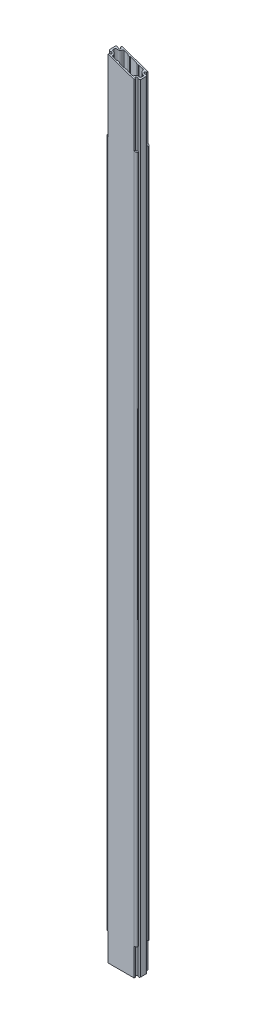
ISO-10303-21;
HEADER;
FILE_DESCRIPTION(('STEP AP214'),'2;1');
FILE_NAME('part.step','',(''),(''),'','','');
FILE_SCHEMA(('AUTOMOTIVE_DESIGN { 1 0 10303 214 1 1 1 1 }'));
ENDSEC;
DATA;
#1=APPLICATION_CONTEXT('core data for automotive mechanical design processes');
#2=APPLICATION_PROTOCOL_DEFINITION('international standard','automotive_design',2000,#1);
#3=PRODUCT_CONTEXT('',#1,'mechanical');
#4=PRODUCT('Part','Part','',(#3));
#5=PRODUCT_RELATED_PRODUCT_CATEGORY('part','',(#4));
#6=PRODUCT_DEFINITION_FORMATION('','',#4);
#7=PRODUCT_DEFINITION_CONTEXT('part definition',#1,'design');
#8=PRODUCT_DEFINITION('design','',#6,#7);
#9=PRODUCT_DEFINITION_SHAPE('','',#8);
#10=(LENGTH_UNIT() NAMED_UNIT(*) SI_UNIT(.MILLI.,.METRE.));
#11=(NAMED_UNIT(*) PLANE_ANGLE_UNIT() SI_UNIT($,.RADIAN.));
#12=(NAMED_UNIT(*) SI_UNIT($,.STERADIAN.) SOLID_ANGLE_UNIT());
#13=UNCERTAINTY_MEASURE_WITH_UNIT(LENGTH_MEASURE(1.E-05),#10,'distance_accuracy_value','');
#14=(GEOMETRIC_REPRESENTATION_CONTEXT(3) GLOBAL_UNCERTAINTY_ASSIGNED_CONTEXT((#13)) GLOBAL_UNIT_ASSIGNED_CONTEXT((#10,
#11,#12)) REPRESENTATION_CONTEXT('',''));
#15=CARTESIAN_POINT('',(0.,0.,0.));
#16=DIRECTION('',(0.,0.,1.));
#17=DIRECTION('',(1.,0.,0.));
#18=AXIS2_PLACEMENT_3D('',#15,#16,#17);
#19=CARTESIAN_POINT('',(84.6938611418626,4584.8,-30.5717765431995));
#20=DIRECTION('',(0.,-1.,0.));
#21=DIRECTION('',(0.,0.,-1.));
#22=AXIS2_PLACEMENT_3D('',#19,#20,#21);
#23=CYLINDRICAL_SURFACE('',#22,3.99999999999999);
#24=CARTESIAN_POINT('',(84.6938611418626,4164.23946157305,-30.5717765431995));
#25=DIRECTION('',(0.327543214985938,0.944836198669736,0.));
#26=DIRECTION('',(0.944836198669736,-0.327543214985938,0.));
#27=AXIS2_PLACEMENT_3D('',#24,#25,#26);
#28=ELLIPSE('',#27,4.23353805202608,3.99999999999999);
#29=CARTESIAN_POINT('',(81.1914378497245,4165.45363497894,-28.6396711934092));
#30=VERTEX_POINT('',#29);
#31=CARTESIAN_POINT('',(88.1962844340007,4163.02528816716,-32.5038818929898));
#32=VERTEX_POINT('',#31);
#33=EDGE_CURVE('E446',#30,#32,#28,.T.);
#34=ORIENTED_EDGE('',*,*,#33,.F.);
#35=DIRECTION('',(0.,-1.,0.));
#36=VECTOR('',#35,1.);
#37=CARTESIAN_POINT('',(81.1914378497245,4584.8,-28.6396711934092));
#38=LINE('',#37,#36);
#39=CARTESIAN_POINT('',(81.1914378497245,160.,-28.6396711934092));
#40=VERTEX_POINT('',#39);
#41=EDGE_CURVE('E1020',#30,#40,#38,.T.);
#42=ORIENTED_EDGE('',*,*,#41,.T.);
#43=CARTESIAN_POINT('',(84.6938611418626,160.,-30.5717765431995));
#44=DIRECTION('',(0.,-1.,0.));
#45=DIRECTION('',(0.,0.,-1.));
#46=AXIS2_PLACEMENT_3D('',#43,#44,#45);
#47=CIRCLE('',#46,3.99999999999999);
#48=CARTESIAN_POINT('',(88.1962844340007,160.,-32.5038818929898));
#49=VERTEX_POINT('',#48);
#50=EDGE_CURVE('E626',#49,#40,#47,.T.);
#51=ORIENTED_EDGE('',*,*,#50,.F.);
#52=DIRECTION('',(0.,-1.,0.));
#53=VECTOR('',#52,1.);
#54=CARTESIAN_POINT('',(88.1962844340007,4584.8,-32.5038818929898));
#55=LINE('',#54,#53);
#56=EDGE_CURVE('E480',#32,#49,#55,.T.);
#57=ORIENTED_EDGE('',*,*,#56,.F.);
#58=EDGE_LOOP('',(#34,#42,#51,#57));
#59=FACE_BOUND('',#58,.T.);
#60=ADVANCED_FACE('F38',(#59),#23,.T.);
#61=CARTESIAN_POINT('',(75.5,4584.8,-25.5));
#62=DIRECTION('',(0.,-1.,0.));
#63=DIRECTION('',(0.,0.,-1.));
#64=AXIS2_PLACEMENT_3D('',#61,#62,#63);
#65=CYLINDRICAL_SURFACE('',#64,14.5);
#66=CARTESIAN_POINT('',(75.5,4167.42666676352,-25.5));
#67=DIRECTION('',(0.327543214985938,0.944836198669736,0.));
#68=DIRECTION('',(0.944836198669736,-0.327543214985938,0.));
#69=AXIS2_PLACEMENT_3D('',#66,#67,#68);
#70=ELLIPSE('',#69,15.3465754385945,14.5);
#71=CARTESIAN_POINT('',(75.4999999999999,4167.42666676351,-40.));
#72=VERTEX_POINT('',#71);
#73=EDGE_CURVE('E440',#32,#72,#70,.T.);
#74=ORIENTED_EDGE('',*,*,#73,.F.);
#75=ORIENTED_EDGE('',*,*,#56,.T.);
#76=CARTESIAN_POINT('',(75.5,160.,-25.5));
#77=DIRECTION('',(0.,-1.,0.));
#78=DIRECTION('',(0.,0.,-1.));
#79=AXIS2_PLACEMENT_3D('',#76,#77,#78);
#80=CIRCLE('',#79,14.5);
#81=CARTESIAN_POINT('',(75.5,160.,-40.));
#82=VERTEX_POINT('',#81);
#83=EDGE_CURVE('E467',#82,#49,#80,.T.);
#84=ORIENTED_EDGE('',*,*,#83,.F.);
#85=DIRECTION('',(0.,-1.,0.));
#86=VECTOR('',#85,1.);
#87=CARTESIAN_POINT('',(75.5,4584.8,-40.));
#88=LINE('',#87,#86);
#89=EDGE_CURVE('E464',#72,#82,#88,.T.);
#90=ORIENTED_EDGE('',*,*,#89,.F.);
#91=EDGE_LOOP('',(#74,#75,#84,#90));
#92=FACE_BOUND('',#91,.T.);
#93=ADVANCED_FACE('F465',(#92),#65,.T.);
#94=CARTESIAN_POINT('',(75.5,4584.8,25.5));
#95=DIRECTION('',(0.,-1.,0.));
#96=DIRECTION('',(0.,0.,-1.));
#97=AXIS2_PLACEMENT_3D('',#94,#95,#96);
#98=CYLINDRICAL_SURFACE('',#97,14.5);
#99=CARTESIAN_POINT('',(75.5,4167.42666676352,25.5));
#100=DIRECTION('',(0.327543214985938,0.944836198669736,0.));
#101=DIRECTION('',(0.944836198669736,-0.327543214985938,0.));
#102=AXIS2_PLACEMENT_3D('',#99,#100,#101);
#103=ELLIPSE('',#102,15.3465754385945,14.5);
#104=CARTESIAN_POINT('',(75.5000000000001,4167.42666676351,40.));
#105=VERTEX_POINT('',#104);
#106=CARTESIAN_POINT('',(88.1962844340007,4163.02528816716,32.5038818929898));
#107=VERTEX_POINT('',#106);
#108=EDGE_CURVE('E533',#105,#107,#103,.T.);
#109=ORIENTED_EDGE('',*,*,#108,.F.);
#110=DIRECTION('',(0.,-1.,0.));
#111=VECTOR('',#110,1.);
#112=CARTESIAN_POINT('',(75.5,4584.8,40.));
#113=LINE('',#112,#111);
#114=CARTESIAN_POINT('',(75.5,160.,40.));
#115=VERTEX_POINT('',#114);
#116=EDGE_CURVE('E554',#105,#115,#113,.T.);
#117=ORIENTED_EDGE('',*,*,#116,.T.);
#118=CARTESIAN_POINT('',(75.5,160.,25.5));
#119=DIRECTION('',(0.,1.,0.));
#120=DIRECTION('',(0.,0.,1.));
#121=AXIS2_PLACEMENT_3D('',#118,#119,#120);
#122=CIRCLE('',#121,14.5);
#123=CARTESIAN_POINT('',(88.1962844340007,160.,32.5038818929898));
#124=VERTEX_POINT('',#123);
#125=EDGE_CURVE('E641',#115,#124,#122,.T.);
#126=ORIENTED_EDGE('',*,*,#125,.T.);
#127=DIRECTION('',(0.,-1.,0.));
#128=VECTOR('',#127,1.);
#129=CARTESIAN_POINT('',(88.1962844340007,4584.8,32.5038818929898));
#130=LINE('',#129,#128);
#131=EDGE_CURVE('E549',#107,#124,#130,.T.);
#132=ORIENTED_EDGE('',*,*,#131,.F.);
#133=EDGE_LOOP('',(#109,#117,#126,#132));
#134=FACE_BOUND('',#133,.T.);
#135=ADVANCED_FACE('F1229',(#134),#98,.T.);
#136=CARTESIAN_POINT('',(84.6938611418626,4584.8,30.5717765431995));
#137=DIRECTION('',(0.,-1.,0.));
#138=DIRECTION('',(0.,0.,-1.));
#139=AXIS2_PLACEMENT_3D('',#136,#137,#138);
#140=CYLINDRICAL_SURFACE('',#139,3.99999999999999);
#141=CARTESIAN_POINT('',(84.6938611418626,4164.23946157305,30.5717765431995));
#142=DIRECTION('',(0.327543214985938,0.944836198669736,0.));
#143=DIRECTION('',(0.944836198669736,-0.327543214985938,0.));
#144=AXIS2_PLACEMENT_3D('',#141,#142,#143);
#145=ELLIPSE('',#144,4.23353805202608,3.99999999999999);
#146=CARTESIAN_POINT('',(81.1914378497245,4165.45363497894,28.6396711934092));
#147=VERTEX_POINT('',#146);
#148=EDGE_CURVE('E46',#107,#147,#145,.T.);
#149=ORIENTED_EDGE('',*,*,#148,.F.);
#150=ORIENTED_EDGE('',*,*,#131,.T.);
#151=CARTESIAN_POINT('',(84.6938611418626,160.,30.5717765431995));
#152=DIRECTION('',(0.,1.,0.));
#153=DIRECTION('',(0.,0.,1.));
#154=AXIS2_PLACEMENT_3D('',#151,#152,#153);
#155=CIRCLE('',#154,3.99999999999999);
#156=CARTESIAN_POINT('',(81.1914378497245,160.,28.6396711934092));
#157=VERTEX_POINT('',#156);
#158=EDGE_CURVE('E547',#124,#157,#155,.T.);
#159=ORIENTED_EDGE('',*,*,#158,.T.);
#160=DIRECTION('',(0.,-1.,0.));
#161=VECTOR('',#160,1.);
#162=CARTESIAN_POINT('',(81.1914378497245,4584.8,28.6396711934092));
#163=LINE('',#162,#161);
#164=EDGE_CURVE('E540',#147,#157,#163,.T.);
#165=ORIENTED_EDGE('',*,*,#164,.F.);
#166=EDGE_LOOP('',(#149,#150,#159,#165));
#167=FACE_BOUND('',#166,.T.);
#168=ADVANCED_FACE('F545',(#167),#140,.T.);
#169=CARTESIAN_POINT('',(-84.6938611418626,4584.8,30.5717765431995));
#170=DIRECTION('',(0.,-1.,0.));
#171=DIRECTION('',(0.,0.,-1.));
#172=AXIS2_PLACEMENT_3D('',#169,#170,#171);
#173=CYLINDRICAL_SURFACE('',#172,3.99999999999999);
#174=CARTESIAN_POINT('',(-84.6938611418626,4162.96053853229,30.5717765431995));
#175=DIRECTION('',(0.327543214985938,0.944836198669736,0.));
#176=DIRECTION('',(0.944836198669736,-0.327543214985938,0.));
#177=AXIS2_PLACEMENT_3D('',#174,#175,#176);
#178=ELLIPSE('',#177,4.23353805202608,3.99999999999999);
#179=CARTESIAN_POINT('',(-81.1914378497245,4161.74636512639,28.6396711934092));
#180=VERTEX_POINT('',#179);
#181=CARTESIAN_POINT('',(-88.1962844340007,4164.17471193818,32.5038818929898));
#182=VERTEX_POINT('',#181);
#183=EDGE_CURVE('E1156',#180,#182,#178,.T.);
#184=ORIENTED_EDGE('',*,*,#183,.F.);
#185=DIRECTION('',(0.,-1.,0.));
#186=VECTOR('',#185,1.);
#187=CARTESIAN_POINT('',(-81.1914378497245,4584.8,28.6396711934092));
#188=LINE('',#187,#186);
#189=CARTESIAN_POINT('',(-81.1914378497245,160.,28.6396711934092));
#190=VERTEX_POINT('',#189);
#191=EDGE_CURVE('E573',#180,#190,#188,.T.);
#192=ORIENTED_EDGE('',*,*,#191,.T.);
#193=CARTESIAN_POINT('',(-84.6938611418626,160.,30.5717765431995));
#194=DIRECTION('',(0.,-1.,0.));
#195=DIRECTION('',(0.,0.,-1.));
#196=AXIS2_PLACEMENT_3D('',#193,#194,#195);
#197=CIRCLE('',#196,3.99999999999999);
#198=CARTESIAN_POINT('',(-88.1962844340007,160.,32.5038818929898));
#199=VERTEX_POINT('',#198);
#200=EDGE_CURVE('E648',#199,#190,#197,.T.);
#201=ORIENTED_EDGE('',*,*,#200,.F.);
#202=DIRECTION('',(0.,-1.,0.));
#203=VECTOR('',#202,1.);
#204=CARTESIAN_POINT('',(-88.1962844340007,4584.8,32.5038818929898));
#205=LINE('',#204,#203);
#206=EDGE_CURVE('E570',#182,#199,#205,.T.);
#207=ORIENTED_EDGE('',*,*,#206,.F.);
#208=EDGE_LOOP('',(#184,#192,#201,#207));
#209=FACE_BOUND('',#208,.T.);
#210=ADVANCED_FACE('F1176',(#209),#173,.T.);
#211=CARTESIAN_POINT('',(-75.5,4584.8,25.5));
#212=DIRECTION('',(0.,-1.,0.));
#213=DIRECTION('',(0.,0.,-1.));
#214=AXIS2_PLACEMENT_3D('',#211,#212,#213);
#215=CYLINDRICAL_SURFACE('',#214,14.5);
#216=CARTESIAN_POINT('',(-75.5,4159.77333334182,25.5));
#217=DIRECTION('',(0.327543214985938,0.944836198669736,0.));
#218=DIRECTION('',(0.944836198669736,-0.327543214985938,0.));
#219=AXIS2_PLACEMENT_3D('',#216,#217,#218);
#220=ELLIPSE('',#219,15.3465754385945,14.5);
#221=CARTESIAN_POINT('',(-75.5000000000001,4159.77333334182,40.));
#222=VERTEX_POINT('',#221);
#223=EDGE_CURVE('E521',#182,#222,#220,.T.);
#224=ORIENTED_EDGE('',*,*,#223,.F.);
#225=ORIENTED_EDGE('',*,*,#206,.T.);
#226=CARTESIAN_POINT('',(-75.5,160.,25.5));
#227=DIRECTION('',(0.,-1.,0.));
#228=DIRECTION('',(0.,0.,-1.));
#229=AXIS2_PLACEMENT_3D('',#226,#227,#228);
#230=CIRCLE('',#229,14.5);
#231=CARTESIAN_POINT('',(-75.5,160.,40.));
#232=VERTEX_POINT('',#231);
#233=EDGE_CURVE('E503',#232,#199,#230,.T.);
#234=ORIENTED_EDGE('',*,*,#233,.F.);
#235=DIRECTION('',(0.,-1.,0.));
#236=VECTOR('',#235,1.);
#237=CARTESIAN_POINT('',(-75.5,4584.8,40.));
#238=LINE('',#237,#236);
#239=EDGE_CURVE('E565',#222,#232,#238,.T.);
#240=ORIENTED_EDGE('',*,*,#239,.F.);
#241=EDGE_LOOP('',(#224,#225,#234,#240));
#242=FACE_BOUND('',#241,.T.);
#243=ADVANCED_FACE('F1416',(#242),#215,.T.);
#244=CARTESIAN_POINT('',(-75.5,4584.8,-25.5));
#245=DIRECTION('',(0.,-1.,0.));
#246=DIRECTION('',(0.,0.,-1.));
#247=AXIS2_PLACEMENT_3D('',#244,#245,#246);
#248=CYLINDRICAL_SURFACE('',#247,14.5);
#249=CARTESIAN_POINT('',(-75.5,4159.77333334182,-25.5));
#250=DIRECTION('',(0.327543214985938,0.944836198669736,0.));
#251=DIRECTION('',(0.944836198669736,-0.327543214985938,0.));
#252=AXIS2_PLACEMENT_3D('',#249,#250,#251);
#253=ELLIPSE('',#252,15.3465754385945,14.5);
#254=CARTESIAN_POINT('',(-75.5000000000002,4159.77333334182,-40.));
#255=VERTEX_POINT('',#254);
#256=CARTESIAN_POINT('',(-88.1962844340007,4164.17471193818,-32.5038818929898));
#257=VERTEX_POINT('',#256);
#258=EDGE_CURVE('E611',#255,#257,#253,.T.);
#259=ORIENTED_EDGE('',*,*,#258,.F.);
#260=DIRECTION('',(0.,-1.,0.));
#261=VECTOR('',#260,1.);
#262=CARTESIAN_POINT('',(-75.5,4584.8,-40.));
#263=LINE('',#262,#261);
#264=CARTESIAN_POINT('',(-75.5,160.,-40.));
#265=VERTEX_POINT('',#264);
#266=EDGE_CURVE('E595',#255,#265,#263,.T.);
#267=ORIENTED_EDGE('',*,*,#266,.T.);
#268=CARTESIAN_POINT('',(-75.5,160.,-25.5));
#269=DIRECTION('',(0.,1.,0.));
#270=DIRECTION('',(0.,0.,1.));
#271=AXIS2_PLACEMENT_3D('',#268,#269,#270);
#272=CIRCLE('',#271,14.5);
#273=CARTESIAN_POINT('',(-88.1962844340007,160.,-32.5038818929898));
#274=VERTEX_POINT('',#273);
#275=EDGE_CURVE('E658',#265,#274,#272,.T.);
#276=ORIENTED_EDGE('',*,*,#275,.T.);
#277=DIRECTION('',(0.,-1.,0.));
#278=VECTOR('',#277,1.);
#279=CARTESIAN_POINT('',(-88.1962844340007,4584.8,-32.5038818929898));
#280=LINE('',#279,#278);
#281=EDGE_CURVE('E593',#257,#274,#280,.T.);
#282=ORIENTED_EDGE('',*,*,#281,.F.);
#283=EDGE_LOOP('',(#259,#267,#276,#282));
#284=FACE_BOUND('',#283,.T.);
#285=ADVANCED_FACE('F612',(#284),#248,.T.);
#286=CARTESIAN_POINT('',(-84.6938611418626,4584.8,-30.5717765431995));
#287=DIRECTION('',(0.,-1.,0.));
#288=DIRECTION('',(0.,0.,-1.));
#289=AXIS2_PLACEMENT_3D('',#286,#287,#288);
#290=CYLINDRICAL_SURFACE('',#289,3.99999999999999);
#291=CARTESIAN_POINT('',(-84.6938611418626,4162.96053853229,-30.5717765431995));
#292=DIRECTION('',(0.327543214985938,0.944836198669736,0.));
#293=DIRECTION('',(0.944836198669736,-0.327543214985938,0.));
#294=AXIS2_PLACEMENT_3D('',#291,#292,#293);
#295=ELLIPSE('',#294,4.23353805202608,3.99999999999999);
#296=CARTESIAN_POINT('',(-81.1914378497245,4161.7463651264,-28.6396711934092));
#297=VERTEX_POINT('',#296);
#298=EDGE_CURVE('E518',#257,#297,#295,.T.);
#299=ORIENTED_EDGE('',*,*,#298,.F.);
#300=ORIENTED_EDGE('',*,*,#281,.T.);
#301=CARTESIAN_POINT('',(-84.6938611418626,160.,-30.5717765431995));
#302=DIRECTION('',(0.,1.,0.));
#303=DIRECTION('',(0.,0.,1.));
#304=AXIS2_PLACEMENT_3D('',#301,#302,#303);
#305=CIRCLE('',#304,3.99999999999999);
#306=CARTESIAN_POINT('',(-81.1914378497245,160.,-28.6396711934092));
#307=VERTEX_POINT('',#306);
#308=EDGE_CURVE('E655',#274,#307,#305,.T.);
#309=ORIENTED_EDGE('',*,*,#308,.T.);
#310=DIRECTION('',(0.,-1.,0.));
#311=VECTOR('',#310,1.);
#312=CARTESIAN_POINT('',(-81.1914378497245,4584.8,-28.6396711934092));
#313=LINE('',#312,#311);
#314=EDGE_CURVE('E591',#297,#307,#313,.T.);
#315=ORIENTED_EDGE('',*,*,#314,.F.);
#316=EDGE_LOOP('',(#299,#300,#309,#315));
#317=FACE_BOUND('',#316,.T.);
#318=ADVANCED_FACE('F1153',(#317),#290,.T.);
#319=CARTESIAN_POINT('',(84.6938611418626,0.,-30.5717765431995));
#320=DIRECTION('',(0.,1.,0.));
#321=DIRECTION('',(0.,0.,1.));
#322=AXIS2_PLACEMENT_3D('',#319,#320,#321);
#323=PLANE('',#322);
#324=CARTESIAN_POINT('',(75.5,0.,-25.5));
#325=DIRECTION('',(0.,-1.,0.));
#326=DIRECTION('',(0.,0.,1.));
#327=AXIS2_PLACEMENT_3D('',#324,#325,#326);
#328=CIRCLE('',#327,14.5);
#329=CARTESIAN_POINT('',(75.5,0.,-11.));
#330=VERTEX_POINT('',#329);
#331=CARTESIAN_POINT('',(61.,0.,-25.5));
#332=VERTEX_POINT('',#331);
#333=EDGE_CURVE('E793',#330,#332,#328,.T.);
#334=ORIENTED_EDGE('',*,*,#333,.T.);
#335=CARTESIAN_POINT('',(54.5,0.,-25.5));
#336=DIRECTION('',(0.,1.,0.));
#337=DIRECTION('',(0.,0.,1.));
#338=AXIS2_PLACEMENT_3D('',#335,#336,#337);
#339=CIRCLE('',#338,6.5);
#340=CARTESIAN_POINT('',(54.5,0.,-32.));
#341=VERTEX_POINT('',#340);
#342=EDGE_CURVE('E797',#332,#341,#339,.T.);
#343=ORIENTED_EDGE('',*,*,#342,.T.);
#344=DIRECTION('',(-1.,0.,0.));
#345=VECTOR('',#344,1.);
#346=CARTESIAN_POINT('',(32.5172988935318,0.,-32.));
#347=LINE('',#346,#345);
#348=CARTESIAN_POINT('',(32.5172988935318,0.,-32.));
#349=VERTEX_POINT('',#348);
#350=EDGE_CURVE('E801',#341,#349,#347,.T.);
#351=ORIENTED_EDGE('',*,*,#350,.T.);
#352=DIRECTION('',(-0.642787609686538,0.,0.766044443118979));
#353=VECTOR('',#352,1.);
#354=CARTESIAN_POINT('',(30.,0.,-29.));
#355=LINE('',#354,#353);
#356=CARTESIAN_POINT('',(30.,0.,-29.));
#357=VERTEX_POINT('',#356);
#358=EDGE_CURVE('E805',#349,#357,#355,.T.);
#359=ORIENTED_EDGE('',*,*,#358,.T.);
#360=DIRECTION('',(-1.,0.,0.));
#361=VECTOR('',#360,1.);
#362=CARTESIAN_POINT('',(20.,0.,-29.));
#363=LINE('',#362,#361);
#364=CARTESIAN_POINT('',(20.,0.,-29.));
#365=VERTEX_POINT('',#364);
#366=EDGE_CURVE('E809',#357,#365,#363,.T.);
#367=ORIENTED_EDGE('',*,*,#366,.T.);
#368=DIRECTION('',(-0.642787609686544,0.,-0.766044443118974));
#369=VECTOR('',#368,1.);
#370=CARTESIAN_POINT('',(20.,0.,-29.));
#371=LINE('',#370,#369);
#372=CARTESIAN_POINT('',(17.4827011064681,0.,-32.));
#373=VERTEX_POINT('',#372);
#374=EDGE_CURVE('E813',#365,#373,#371,.T.);
#375=ORIENTED_EDGE('',*,*,#374,.T.);
#376=DIRECTION('',(-1.,0.,0.));
#377=VECTOR('',#376,1.);
#378=CARTESIAN_POINT('',(-17.4827011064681,0.,-32.));
#379=LINE('',#378,#377);
#380=CARTESIAN_POINT('',(-17.4827011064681,0.,-32.));
#381=VERTEX_POINT('',#380);
#382=EDGE_CURVE('E817',#373,#381,#379,.T.);
#383=ORIENTED_EDGE('',*,*,#382,.T.);
#384=DIRECTION('',(-0.642787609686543,0.,0.766044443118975));
#385=VECTOR('',#384,1.);
#386=CARTESIAN_POINT('',(-20.,0.,-29.));
#387=LINE('',#386,#385);
#388=CARTESIAN_POINT('',(-20.,0.,-29.));
#389=VERTEX_POINT('',#388);
#390=EDGE_CURVE('E821',#381,#389,#387,.T.);
#391=ORIENTED_EDGE('',*,*,#390,.T.);
#392=DIRECTION('',(-1.,0.,0.));
#393=VECTOR('',#392,1.);
#394=CARTESIAN_POINT('',(-20.,0.,-29.));
#395=LINE('',#394,#393);
#396=CARTESIAN_POINT('',(-30.,0.,-29.));
#397=VERTEX_POINT('',#396);
#398=EDGE_CURVE('E825',#389,#397,#395,.T.);
#399=ORIENTED_EDGE('',*,*,#398,.T.);
#400=DIRECTION('',(-0.642787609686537,0.,-0.76604444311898));
#401=VECTOR('',#400,1.);
#402=CARTESIAN_POINT('',(-30.,0.,-29.));
#403=LINE('',#402,#401);
#404=CARTESIAN_POINT('',(-32.5172988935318,0.,-32.));
#405=VERTEX_POINT('',#404);
#406=EDGE_CURVE('E829',#397,#405,#403,.T.);
#407=ORIENTED_EDGE('',*,*,#406,.T.);
#408=DIRECTION('',(-1.,0.,0.));
#409=VECTOR('',#408,1.);
#410=CARTESIAN_POINT('',(-32.5172988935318,0.,-32.));
#411=LINE('',#410,#409);
#412=CARTESIAN_POINT('',(-54.5,0.,-32.));
#413=VERTEX_POINT('',#412);
#414=EDGE_CURVE('E833',#405,#413,#411,.T.);
#415=ORIENTED_EDGE('',*,*,#414,.T.);
#416=CARTESIAN_POINT('',(-54.5,0.,-25.5));
#417=DIRECTION('',(0.,1.,0.));
#418=DIRECTION('',(0.,0.,-1.));
#419=AXIS2_PLACEMENT_3D('',#416,#417,#418);
#420=CIRCLE('',#419,6.5);
#421=CARTESIAN_POINT('',(-61.,0.,-25.5));
#422=VERTEX_POINT('',#421);
#423=EDGE_CURVE('E837',#413,#422,#420,.T.);
#424=ORIENTED_EDGE('',*,*,#423,.T.);
#425=CARTESIAN_POINT('',(-75.5,0.,-25.5));
#426=DIRECTION('',(0.,-1.,0.));
#427=DIRECTION('',(0.,0.,-1.));
#428=AXIS2_PLACEMENT_3D('',#425,#426,#427);
#429=CIRCLE('',#428,14.5);
#430=CARTESIAN_POINT('',(-75.5,0.,-11.));
#431=VERTEX_POINT('',#430);
#432=EDGE_CURVE('E841',#422,#431,#429,.T.);
#433=ORIENTED_EDGE('',*,*,#432,.T.);
#434=CARTESIAN_POINT('',(-75.5,0.,-4.5));
#435=DIRECTION('',(0.,1.,0.));
#436=DIRECTION('',(0.,0.,-1.));
#437=AXIS2_PLACEMENT_3D('',#434,#435,#436);
#438=CIRCLE('',#437,6.5);
#439=CARTESIAN_POINT('',(-82.,0.,-4.5));
#440=VERTEX_POINT('',#439);
#441=EDGE_CURVE('E845',#431,#440,#438,.T.);
#442=ORIENTED_EDGE('',*,*,#441,.T.);
#443=DIRECTION('',(0.,0.,1.));
#444=VECTOR('',#443,1.);
#445=CARTESIAN_POINT('',(-82.,0.,-4.5));
#446=LINE('',#445,#444);
#447=CARTESIAN_POINT('',(-82.,0.,4.5));
#448=VERTEX_POINT('',#447);
#449=EDGE_CURVE('E849',#440,#448,#446,.T.);
#450=ORIENTED_EDGE('',*,*,#449,.T.);
#451=CARTESIAN_POINT('',(-75.5,0.,4.5));
#452=DIRECTION('',(0.,1.,0.));
#453=DIRECTION('',(0.,0.,1.));
#454=AXIS2_PLACEMENT_3D('',#451,#452,#453);
#455=CIRCLE('',#454,6.5);
#456=CARTESIAN_POINT('',(-75.5,0.,11.));
#457=VERTEX_POINT('',#456);
#458=EDGE_CURVE('E853',#448,#457,#455,.T.);
#459=ORIENTED_EDGE('',*,*,#458,.T.);
#460=CARTESIAN_POINT('',(-75.5,0.,25.5));
#461=DIRECTION('',(0.,-1.,0.));
#462=DIRECTION('',(0.,0.,1.));
#463=AXIS2_PLACEMENT_3D('',#460,#461,#462);
#464=CIRCLE('',#463,14.5);
#465=CARTESIAN_POINT('',(-61.,0.,25.5));
#466=VERTEX_POINT('',#465);
#467=EDGE_CURVE('E857',#457,#466,#464,.T.);
#468=ORIENTED_EDGE('',*,*,#467,.T.);
#469=CARTESIAN_POINT('',(-54.5,0.,25.5));
#470=DIRECTION('',(0.,1.,0.));
#471=DIRECTION('',(0.,0.,1.));
#472=AXIS2_PLACEMENT_3D('',#469,#470,#471);
#473=CIRCLE('',#472,6.5);
#474=CARTESIAN_POINT('',(-54.5,0.,32.));
#475=VERTEX_POINT('',#474);
#476=EDGE_CURVE('E861',#466,#475,#473,.T.);
#477=ORIENTED_EDGE('',*,*,#476,.T.);
#478=DIRECTION('',(1.,0.,0.));
#479=VECTOR('',#478,1.);
#480=CARTESIAN_POINT('',(-32.5172988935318,0.,32.));
#481=LINE('',#480,#479);
#482=CARTESIAN_POINT('',(-32.5172988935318,0.,32.));
#483=VERTEX_POINT('',#482);
#484=EDGE_CURVE('E865',#475,#483,#481,.T.);
#485=ORIENTED_EDGE('',*,*,#484,.T.);
#486=DIRECTION('',(0.642787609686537,0.,-0.76604444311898));
#487=VECTOR('',#486,1.);
#488=CARTESIAN_POINT('',(-30.,0.,29.));
#489=LINE('',#488,#487);
#490=CARTESIAN_POINT('',(-30.,0.,29.));
#491=VERTEX_POINT('',#490);
#492=EDGE_CURVE('E869',#483,#491,#489,.T.);
#493=ORIENTED_EDGE('',*,*,#492,.T.);
#494=DIRECTION('',(1.,0.,0.));
#495=VECTOR('',#494,1.);
#496=CARTESIAN_POINT('',(-20.,0.,29.));
#497=LINE('',#496,#495);
#498=CARTESIAN_POINT('',(-20.,0.,29.));
#499=VERTEX_POINT('',#498);
#500=EDGE_CURVE('E873',#491,#499,#497,.T.);
#501=ORIENTED_EDGE('',*,*,#500,.T.);
#502=DIRECTION('',(0.642787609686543,0.,0.766044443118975));
#503=VECTOR('',#502,1.);
#504=CARTESIAN_POINT('',(-20.,0.,29.));
#505=LINE('',#504,#503);
#506=CARTESIAN_POINT('',(-17.4827011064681,0.,32.));
#507=VERTEX_POINT('',#506);
#508=EDGE_CURVE('E877',#499,#507,#505,.T.);
#509=ORIENTED_EDGE('',*,*,#508,.T.);
#510=DIRECTION('',(1.,0.,0.));
#511=VECTOR('',#510,1.);
#512=CARTESIAN_POINT('',(-17.4827011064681,0.,32.));
#513=LINE('',#512,#511);
#514=CARTESIAN_POINT('',(17.4827011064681,0.,32.));
#515=VERTEX_POINT('',#514);
#516=EDGE_CURVE('E881',#507,#515,#513,.T.);
#517=ORIENTED_EDGE('',*,*,#516,.T.);
#518=DIRECTION('',(0.642787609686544,0.,-0.766044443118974));
#519=VECTOR('',#518,1.);
#520=CARTESIAN_POINT('',(20.,0.,29.));
#521=LINE('',#520,#519);
#522=CARTESIAN_POINT('',(20.,0.,29.));
#523=VERTEX_POINT('',#522);
#524=EDGE_CURVE('E885',#515,#523,#521,.T.);
#525=ORIENTED_EDGE('',*,*,#524,.T.);
#526=DIRECTION('',(1.,0.,0.));
#527=VECTOR('',#526,1.);
#528=CARTESIAN_POINT('',(20.,0.,29.));
#529=LINE('',#528,#527);
#530=CARTESIAN_POINT('',(30.,0.,29.));
#531=VERTEX_POINT('',#530);
#532=EDGE_CURVE('E889',#523,#531,#529,.T.);
#533=ORIENTED_EDGE('',*,*,#532,.T.);
#534=DIRECTION('',(0.642787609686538,0.,0.766044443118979));
#535=VECTOR('',#534,1.);
#536=CARTESIAN_POINT('',(30.,0.,29.));
#537=LINE('',#536,#535);
#538=CARTESIAN_POINT('',(32.5172988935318,0.,32.));
#539=VERTEX_POINT('',#538);
#540=EDGE_CURVE('E893',#531,#539,#537,.T.);
#541=ORIENTED_EDGE('',*,*,#540,.T.);
#542=DIRECTION('',(1.,0.,0.));
#543=VECTOR('',#542,1.);
#544=CARTESIAN_POINT('',(32.5172988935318,0.,32.));
#545=LINE('',#544,#543);
#546=CARTESIAN_POINT('',(54.5,0.,32.));
#547=VERTEX_POINT('',#546);
#548=EDGE_CURVE('E897',#539,#547,#545,.T.);
#549=ORIENTED_EDGE('',*,*,#548,.T.);
#550=CARTESIAN_POINT('',(54.5,0.,25.5));
#551=DIRECTION('',(0.,1.,0.));
#552=DIRECTION('',(0.,0.,-1.));
#553=AXIS2_PLACEMENT_3D('',#550,#551,#552);
#554=CIRCLE('',#553,6.5);
#555=CARTESIAN_POINT('',(61.,0.,25.5));
#556=VERTEX_POINT('',#555);
#557=EDGE_CURVE('E901',#547,#556,#554,.T.);
#558=ORIENTED_EDGE('',*,*,#557,.T.);
#559=CARTESIAN_POINT('',(75.5,0.,25.5));
#560=DIRECTION('',(0.,-1.,0.));
#561=DIRECTION('',(0.,0.,-1.));
#562=AXIS2_PLACEMENT_3D('',#559,#560,#561);
#563=CIRCLE('',#562,14.5);
#564=CARTESIAN_POINT('',(75.5,0.,11.));
#565=VERTEX_POINT('',#564);
#566=EDGE_CURVE('E905',#556,#565,#563,.T.);
#567=ORIENTED_EDGE('',*,*,#566,.T.);
#568=CARTESIAN_POINT('',(75.5,0.,4.5));
#569=DIRECTION('',(0.,1.,0.));
#570=DIRECTION('',(0.,0.,-1.));
#571=AXIS2_PLACEMENT_3D('',#568,#569,#570);
#572=CIRCLE('',#571,6.5);
#573=CARTESIAN_POINT('',(82.,0.,4.5));
#574=VERTEX_POINT('',#573);
#575=EDGE_CURVE('E909',#565,#574,#572,.T.);
#576=ORIENTED_EDGE('',*,*,#575,.T.);
#577=DIRECTION('',(0.,0.,-1.));
#578=VECTOR('',#577,1.);
#579=CARTESIAN_POINT('',(82.,0.,-4.5));
#580=LINE('',#579,#578);
#581=CARTESIAN_POINT('',(82.,0.,-4.5));
#582=VERTEX_POINT('',#581);
#583=EDGE_CURVE('E913',#574,#582,#580,.T.);
#584=ORIENTED_EDGE('',*,*,#583,.T.);
#585=CARTESIAN_POINT('',(75.5,0.,-4.5));
#586=DIRECTION('',(0.,1.,0.));
#587=DIRECTION('',(0.,0.,1.));
#588=AXIS2_PLACEMENT_3D('',#585,#586,#587);
#589=CIRCLE('',#588,6.5);
#590=EDGE_CURVE('E917',#582,#330,#589,.T.);
#591=ORIENTED_EDGE('',*,*,#590,.T.);
#592=EDGE_LOOP('',(#334,#343,#351,#359,#367,#375,#383,#391,#399,#407,#415,#424,#433,#442,#450,
#459,#468,#477,#485,#493,#501,#509,#517,#525,#533,#541,#549,#558,#567,#576,#584,#591));
#593=FACE_BOUND('',#592,.T.);
#594=DIRECTION('',(0.,0.,1.));
#595=VECTOR('',#594,1.);
#596=CARTESIAN_POINT('',(75.5,0.,-25.5));
#597=LINE('',#596,#595);
#598=CARTESIAN_POINT('',(75.5,0.,-40.));
#599=VERTEX_POINT('',#598);
#600=CARTESIAN_POINT('',(75.5,0.,-32.));
#601=VERTEX_POINT('',#600);
#602=EDGE_CURVE('E1134',#599,#601,#597,.T.);
#603=ORIENTED_EDGE('',*,*,#602,.T.);
#604=CARTESIAN_POINT('',(75.5,0.,-25.5));
#605=DIRECTION('',(0.,-1.,0.));
#606=DIRECTION('',(0.,0.,1.));
#607=AXIS2_PLACEMENT_3D('',#604,#605,#606);
#608=CIRCLE('',#607,6.5);
#609=CARTESIAN_POINT('',(79.7220192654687,0.,-20.5578796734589));
#610=VERTEX_POINT('',#609);
#611=EDGE_CURVE('E1021',#610,#601,#608,.T.);
#612=ORIENTED_EDGE('',*,*,#611,.F.);
#613=CARTESIAN_POINT('',(83.7691890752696,0.,-15.8204308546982));
#614=DIRECTION('',(0.,1.,0.));
#615=DIRECTION('',(0.,0.,1.));
#616=AXIS2_PLACEMENT_3D('',#613,#614,#615);
#617=CIRCLE('',#616,6.23081092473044);
#618=CARTESIAN_POINT('',(90.,0.,-15.8204308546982));
#619=VERTEX_POINT('',#618);
#620=EDGE_CURVE('E1056',#619,#610,#617,.T.);
#621=ORIENTED_EDGE('',*,*,#620,.F.);
#622=DIRECTION('',(0.,0.,-1.));
#623=VECTOR('',#622,1.);
#624=CARTESIAN_POINT('',(90.,0.,15.8204308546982));
#625=LINE('',#624,#623);
#626=CARTESIAN_POINT('',(90.,0.,15.8204308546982));
#627=VERTEX_POINT('',#626);
#628=EDGE_CURVE('E1052',#627,#619,#625,.T.);
#629=ORIENTED_EDGE('',*,*,#628,.F.);
#630=CARTESIAN_POINT('',(83.7691890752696,0.,15.8204308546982));
#631=DIRECTION('',(0.,1.,0.));
#632=DIRECTION('',(0.,0.,-1.));
#633=AXIS2_PLACEMENT_3D('',#630,#631,#632);
#634=CIRCLE('',#633,6.23081092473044);
#635=CARTESIAN_POINT('',(79.7220192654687,0.,20.5578796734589));
#636=VERTEX_POINT('',#635);
#637=EDGE_CURVE('E1048',#636,#627,#634,.T.);
#638=ORIENTED_EDGE('',*,*,#637,.F.);
#639=CARTESIAN_POINT('',(75.5,0.,25.5));
#640=DIRECTION('',(0.,-1.,0.));
#641=DIRECTION('',(0.,0.,-1.));
#642=AXIS2_PLACEMENT_3D('',#639,#640,#641);
#643=CIRCLE('',#642,6.5);
#644=CARTESIAN_POINT('',(75.5,0.,32.));
#645=VERTEX_POINT('',#644);
#646=EDGE_CURVE('E1045',#645,#636,#643,.T.);
#647=ORIENTED_EDGE('',*,*,#646,.F.);
#648=DIRECTION('',(0.,0.,1.));
#649=VECTOR('',#648,1.);
#650=CARTESIAN_POINT('',(75.5,0.,25.5));
#651=LINE('',#650,#649);
#652=CARTESIAN_POINT('',(75.5,0.,40.));
#653=VERTEX_POINT('',#652);
#654=EDGE_CURVE('E1096',#645,#653,#651,.T.);
#655=ORIENTED_EDGE('',*,*,#654,.T.);
#656=DIRECTION('',(1.,0.,0.));
#657=VECTOR('',#656,1.);
#658=CARTESIAN_POINT('',(75.5,0.,40.));
#659=LINE('',#658,#657);
#660=CARTESIAN_POINT('',(-75.5,0.,40.));
#661=VERTEX_POINT('',#660);
#662=EDGE_CURVE('E1041',#661,#653,#659,.T.);
#663=ORIENTED_EDGE('',*,*,#662,.F.);
#664=DIRECTION('',(0.,0.,-1.));
#665=VECTOR('',#664,1.);
#666=CARTESIAN_POINT('',(-75.5,0.,25.5));
#667=LINE('',#666,#665);
#668=CARTESIAN_POINT('',(-75.5,0.,32.));
#669=VERTEX_POINT('',#668);
#670=EDGE_CURVE('E1121',#661,#669,#667,.T.);
#671=ORIENTED_EDGE('',*,*,#670,.T.);
#672=CARTESIAN_POINT('',(-75.5,0.,25.5));
#673=DIRECTION('',(0.,-1.,0.));
#674=DIRECTION('',(0.,0.,1.));
#675=AXIS2_PLACEMENT_3D('',#672,#673,#674);
#676=CIRCLE('',#675,6.5);
#677=CARTESIAN_POINT('',(-79.7220192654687,0.,20.5578796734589));
#678=VERTEX_POINT('',#677);
#679=EDGE_CURVE('E1037',#678,#669,#676,.T.);
#680=ORIENTED_EDGE('',*,*,#679,.F.);
#681=CARTESIAN_POINT('',(-83.7691890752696,0.,15.8204308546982));
#682=DIRECTION('',(0.,1.,0.));
#683=DIRECTION('',(0.,0.,1.));
#684=AXIS2_PLACEMENT_3D('',#681,#682,#683);
#685=CIRCLE('',#684,6.23081092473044);
#686=CARTESIAN_POINT('',(-90.,0.,15.8204308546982));
#687=VERTEX_POINT('',#686);
#688=EDGE_CURVE('E1033',#687,#678,#685,.T.);
#689=ORIENTED_EDGE('',*,*,#688,.F.);
#690=DIRECTION('',(0.,0.,1.));
#691=VECTOR('',#690,1.);
#692=CARTESIAN_POINT('',(-90.,0.,15.8204308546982));
#693=LINE('',#692,#691);
#694=CARTESIAN_POINT('',(-90.,0.,-15.8204308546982));
#695=VERTEX_POINT('',#694);
#696=EDGE_CURVE('E1030',#695,#687,#693,.T.);
#697=ORIENTED_EDGE('',*,*,#696,.F.);
#698=CARTESIAN_POINT('',(-83.7691890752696,0.,-15.8204308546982));
#699=DIRECTION('',(0.,1.,0.));
#700=DIRECTION('',(0.,0.,-1.));
#701=AXIS2_PLACEMENT_3D('',#698,#699,#700);
#702=CIRCLE('',#701,6.23081092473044);
#703=CARTESIAN_POINT('',(-79.7220192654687,0.,-20.5578796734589));
#704=VERTEX_POINT('',#703);
#705=EDGE_CURVE('E1027',#704,#695,#702,.T.);
#706=ORIENTED_EDGE('',*,*,#705,.F.);
#707=CARTESIAN_POINT('',(-75.5,0.,-25.5));
#708=DIRECTION('',(0.,-1.,0.));
#709=DIRECTION('',(0.,0.,-1.));
#710=AXIS2_PLACEMENT_3D('',#707,#708,#709);
#711=CIRCLE('',#710,6.5);
#712=CARTESIAN_POINT('',(-75.5,0.,-32.));
#713=VERTEX_POINT('',#712);
#714=EDGE_CURVE('E1024',#713,#704,#711,.T.);
#715=ORIENTED_EDGE('',*,*,#714,.F.);
#716=DIRECTION('',(0.,0.,-1.));
#717=VECTOR('',#716,1.);
#718=CARTESIAN_POINT('',(-75.5,0.,-25.5));
#719=LINE('',#718,#717);
#720=CARTESIAN_POINT('',(-75.5,0.,-40.));
#721=VERTEX_POINT('',#720);
#722=EDGE_CURVE('E633',#713,#721,#719,.T.);
#723=ORIENTED_EDGE('',*,*,#722,.T.);
#724=DIRECTION('',(-1.,0.,0.));
#725=VECTOR('',#724,1.);
#726=CARTESIAN_POINT('',(75.5,0.,-40.));
#727=LINE('',#726,#725);
#728=EDGE_CURVE('E621',#599,#721,#727,.T.);
#729=ORIENTED_EDGE('',*,*,#728,.F.);
#730=EDGE_LOOP('',(#603,#612,#621,#629,#638,#647,#655,#663,#671,#680,#689,#697,#706,#715,#723,#729));
#731=FACE_BOUND('',#730,.T.);
#732=ADVANCED_FACE('F1084',(#593,#731),#323,.F.);
#733=CARTESIAN_POINT('',(-75.5,4584.8,-25.5));
#734=DIRECTION('',(0.,-1.,0.));
#735=DIRECTION('',(0.,0.,-1.));
#736=AXIS2_PLACEMENT_3D('',#733,#734,#735);
#737=CYLINDRICAL_SURFACE('',#736,6.5);
#738=CARTESIAN_POINT('',(-75.5,4579.77333334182,-25.5));
#739=DIRECTION('',(-0.327543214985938,-0.944836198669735,0.));
#740=DIRECTION('',(0.944836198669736,-0.327543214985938,0.));
#741=AXIS2_PLACEMENT_3D('',#738,#739,#740);
#742=ELLIPSE('',#741,6.87949933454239,6.5);
#743=CARTESIAN_POINT('',(-79.7220192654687,4581.23696668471,-20.5578796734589));
#744=VERTEX_POINT('',#743);
#745=CARTESIAN_POINT('',(-75.5,4579.77333334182,-32.));
#746=VERTEX_POINT('',#745);
#747=EDGE_CURVE('E789',#744,#746,#742,.F.);
#748=ORIENTED_EDGE('',*,*,#747,.T.);
#749=DIRECTION('',(0.,-1.,0.));
#750=VECTOR('',#749,1.);
#751=CARTESIAN_POINT('',(-75.5,4584.8,-32.));
#752=LINE('',#751,#750);
#753=CARTESIAN_POINT('',(-75.5,4159.77333334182,-32.));
#754=VERTEX_POINT('',#753);
#755=EDGE_CURVE('E61',#746,#754,#752,.T.);
#756=ORIENTED_EDGE('',*,*,#755,.T.);
#757=CARTESIAN_POINT('',(-75.5,4159.77333334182,-25.5));
#758=DIRECTION('',(0.327543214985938,0.944836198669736,0.));
#759=DIRECTION('',(0.944836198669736,-0.327543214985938,0.));
#760=AXIS2_PLACEMENT_3D('',#757,#758,#759);
#761=ELLIPSE('',#760,6.87949933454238,6.5);
#762=EDGE_CURVE('E615',#297,#754,#761,.F.);
#763=ORIENTED_EDGE('',*,*,#762,.F.);
#764=ORIENTED_EDGE('',*,*,#314,.T.);
#765=CARTESIAN_POINT('',(-75.5,160.,-25.5));
#766=DIRECTION('',(0.,1.,0.));
#767=DIRECTION('',(0.,0.,1.));
#768=AXIS2_PLACEMENT_3D('',#765,#766,#767);
#769=CIRCLE('',#768,6.5);
#770=CARTESIAN_POINT('',(-75.5,160.,-32.));
#771=VERTEX_POINT('',#770);
#772=EDGE_CURVE('E507',#307,#771,#769,.F.);
#773=ORIENTED_EDGE('',*,*,#772,.T.);
#774=DIRECTION('',(0.,-1.,0.));
#775=VECTOR('',#774,1.);
#776=CARTESIAN_POINT('',(-75.5,4584.8,-32.));
#777=LINE('',#776,#775);
#778=EDGE_CURVE('E511',#713,#771,#777,.F.);
#779=ORIENTED_EDGE('',*,*,#778,.F.);
#780=ORIENTED_EDGE('',*,*,#714,.T.);
#781=DIRECTION('',(0.,-1.,0.));
#782=VECTOR('',#781,1.);
#783=CARTESIAN_POINT('',(-79.7220192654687,4584.8,-20.5578796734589));
#784=LINE('',#783,#782);
#785=EDGE_CURVE('E587',#744,#704,#784,.T.);
#786=ORIENTED_EDGE('',*,*,#785,.F.);
#787=EDGE_LOOP('',(#748,#756,#763,#764,#773,#779,#780,#786));
#788=FACE_BOUND('',#787,.T.);
#789=ADVANCED_FACE('F1146',(#788),#737,.F.);
#790=CARTESIAN_POINT('',(-75.5,4584.8,25.5));
#791=DIRECTION('',(0.,-1.,0.));
#792=DIRECTION('',(0.,0.,-1.));
#793=AXIS2_PLACEMENT_3D('',#790,#791,#792);
#794=CYLINDRICAL_SURFACE('',#793,6.5);
#795=CARTESIAN_POINT('',(-75.5,4159.77333334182,25.5));
#796=DIRECTION('',(0.327543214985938,0.944836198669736,0.));
#797=DIRECTION('',(0.944836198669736,-0.327543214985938,0.));
#798=AXIS2_PLACEMENT_3D('',#795,#796,#797);
#799=ELLIPSE('',#798,6.87949933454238,6.5);
#800=CARTESIAN_POINT('',(-75.5,4159.77333334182,32.));
#801=VERTEX_POINT('',#800);
#802=EDGE_CURVE('E1137',#801,#180,#799,.F.);
#803=ORIENTED_EDGE('',*,*,#802,.F.);
#804=DIRECTION('',(0.,-1.,0.));
#805=VECTOR('',#804,1.);
#806=CARTESIAN_POINT('',(-75.5,4584.8,32.));
#807=LINE('',#806,#805);
#808=CARTESIAN_POINT('',(-75.5,4579.77333334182,32.));
#809=VERTEX_POINT('',#808);
#810=EDGE_CURVE('E1217',#801,#809,#807,.F.);
#811=ORIENTED_EDGE('',*,*,#810,.T.);
#812=CARTESIAN_POINT('',(-75.5,4579.77333334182,25.5));
#813=DIRECTION('',(-0.327543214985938,-0.944836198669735,0.));
#814=DIRECTION('',(0.944836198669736,-0.327543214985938,0.));
#815=AXIS2_PLACEMENT_3D('',#812,#813,#814);
#816=ELLIPSE('',#815,6.87949933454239,6.5);
#817=CARTESIAN_POINT('',(-79.7220192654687,4581.23696668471,20.5578796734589));
#818=VERTEX_POINT('',#817);
#819=EDGE_CURVE('E778',#809,#818,#816,.F.);
#820=ORIENTED_EDGE('',*,*,#819,.T.);
#821=DIRECTION('',(0.,-1.,0.));
#822=VECTOR('',#821,1.);
#823=CARTESIAN_POINT('',(-79.7220192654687,4584.8,20.5578796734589));
#824=LINE('',#823,#822);
#825=EDGE_CURVE('E576',#818,#678,#824,.T.);
#826=ORIENTED_EDGE('',*,*,#825,.T.);
#827=ORIENTED_EDGE('',*,*,#679,.T.);
#828=DIRECTION('',(0.,-1.,0.));
#829=VECTOR('',#828,1.);
#830=CARTESIAN_POINT('',(-75.5,4584.8,32.));
#831=LINE('',#830,#829);
#832=CARTESIAN_POINT('',(-75.5,160.,32.));
#833=VERTEX_POINT('',#832);
#834=EDGE_CURVE('E645',#833,#669,#831,.T.);
#835=ORIENTED_EDGE('',*,*,#834,.F.);
#836=CARTESIAN_POINT('',(-75.5,160.,25.5));
#837=DIRECTION('',(0.,-1.,0.));
#838=DIRECTION('',(0.,0.,-1.));
#839=AXIS2_PLACEMENT_3D('',#836,#837,#838);
#840=CIRCLE('',#839,6.5);
#841=EDGE_CURVE('E652',#190,#833,#840,.F.);
#842=ORIENTED_EDGE('',*,*,#841,.F.);
#843=ORIENTED_EDGE('',*,*,#191,.F.);
#844=EDGE_LOOP('',(#803,#811,#820,#826,#827,#835,#842,#843));
#845=FACE_BOUND('',#844,.T.);
#846=ADVANCED_FACE('F1179',(#845),#794,.F.);
#847=CARTESIAN_POINT('',(75.5,4584.8,25.5));
#848=DIRECTION('',(0.,-1.,0.));
#849=DIRECTION('',(0.,0.,-1.));
#850=AXIS2_PLACEMENT_3D('',#847,#848,#849);
#851=CYLINDRICAL_SURFACE('',#850,6.5);
#852=CARTESIAN_POINT('',(75.5,4527.42666676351,25.5));
#853=DIRECTION('',(-0.327543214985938,-0.944836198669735,0.));
#854=DIRECTION('',(0.944836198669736,-0.327543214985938,0.));
#855=AXIS2_PLACEMENT_3D('',#852,#853,#854);
#856=ELLIPSE('',#855,6.87949933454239,6.5);
#857=CARTESIAN_POINT('',(79.7220192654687,4525.96303342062,20.5578796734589));
#858=VERTEX_POINT('',#857);
#859=CARTESIAN_POINT('',(75.5,4527.42666676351,32.));
#860=VERTEX_POINT('',#859);
#861=EDGE_CURVE('E775',#858,#860,#856,.F.);
#862=ORIENTED_EDGE('',*,*,#861,.T.);
#863=DIRECTION('',(0.,-1.,0.));
#864=VECTOR('',#863,1.);
#865=CARTESIAN_POINT('',(75.5,4584.8,32.));
#866=LINE('',#865,#864);
#867=CARTESIAN_POINT('',(75.5,4167.42666676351,32.));
#868=VERTEX_POINT('',#867);
#869=EDGE_CURVE('E53',#860,#868,#866,.T.);
#870=ORIENTED_EDGE('',*,*,#869,.T.);
#871=CARTESIAN_POINT('',(75.5,4167.42666676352,25.5));
#872=DIRECTION('',(0.327543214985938,0.944836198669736,0.));
#873=DIRECTION('',(0.944836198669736,-0.327543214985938,0.));
#874=AXIS2_PLACEMENT_3D('',#871,#872,#873);
#875=ELLIPSE('',#874,6.87949933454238,6.5);
#876=EDGE_CURVE('E531',#147,#868,#875,.F.);
#877=ORIENTED_EDGE('',*,*,#876,.F.);
#878=ORIENTED_EDGE('',*,*,#164,.T.);
#879=CARTESIAN_POINT('',(75.5,160.,25.5));
#880=DIRECTION('',(0.,1.,0.));
#881=DIRECTION('',(0.,0.,1.));
#882=AXIS2_PLACEMENT_3D('',#879,#880,#881);
#883=CIRCLE('',#882,6.5);
#884=CARTESIAN_POINT('',(75.5,160.,32.));
#885=VERTEX_POINT('',#884);
#886=EDGE_CURVE('E495',#157,#885,#883,.F.);
#887=ORIENTED_EDGE('',*,*,#886,.T.);
#888=DIRECTION('',(0.,-1.,0.));
#889=VECTOR('',#888,1.);
#890=CARTESIAN_POINT('',(75.5,4584.8,32.));
#891=LINE('',#890,#889);
#892=EDGE_CURVE('E499',#645,#885,#891,.F.);
#893=ORIENTED_EDGE('',*,*,#892,.F.);
#894=ORIENTED_EDGE('',*,*,#646,.T.);
#895=DIRECTION('',(0.,-1.,0.));
#896=VECTOR('',#895,1.);
#897=CARTESIAN_POINT('',(79.7220192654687,4584.8,20.5578796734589));
#898=LINE('',#897,#896);
#899=EDGE_CURVE('E550',#858,#636,#898,.T.);
#900=ORIENTED_EDGE('',*,*,#899,.F.);
#901=EDGE_LOOP('',(#862,#870,#877,#878,#887,#893,#894,#900));
#902=FACE_BOUND('',#901,.T.);
#903=ADVANCED_FACE('F539',(#902),#851,.F.);
#904=CARTESIAN_POINT('',(75.5,4584.8,-25.5));
#905=DIRECTION('',(0.,-1.,0.));
#906=DIRECTION('',(0.,0.,-1.));
#907=AXIS2_PLACEMENT_3D('',#904,#905,#906);
#908=CYLINDRICAL_SURFACE('',#907,6.5);
#909=CARTESIAN_POINT('',(75.5,4167.42666676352,-25.5));
#910=DIRECTION('',(0.327543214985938,0.944836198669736,0.));
#911=DIRECTION('',(0.944836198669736,-0.327543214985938,0.));
#912=AXIS2_PLACEMENT_3D('',#909,#910,#911);
#913=ELLIPSE('',#912,6.87949933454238,6.5);
#914=CARTESIAN_POINT('',(75.5,4167.42666676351,-32.));
#915=VERTEX_POINT('',#914);
#916=EDGE_CURVE('E11',#915,#30,#913,.F.);
#917=ORIENTED_EDGE('',*,*,#916,.F.);
#918=DIRECTION('',(0.,-1.,0.));
#919=VECTOR('',#918,1.);
#920=CARTESIAN_POINT('',(75.5,4584.8,-32.));
#921=LINE('',#920,#919);
#922=CARTESIAN_POINT('',(75.5,4527.42666676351,-32.));
#923=VERTEX_POINT('',#922);
#924=EDGE_CURVE('E459',#915,#923,#921,.F.);
#925=ORIENTED_EDGE('',*,*,#924,.T.);
#926=CARTESIAN_POINT('',(75.5,4527.42666676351,-25.5));
#927=DIRECTION('',(-0.327543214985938,-0.944836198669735,0.));
#928=DIRECTION('',(0.944836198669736,-0.327543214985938,0.));
#929=AXIS2_PLACEMENT_3D('',#926,#927,#928);
#930=ELLIPSE('',#929,6.87949933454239,6.5);
#931=CARTESIAN_POINT('',(79.7220192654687,4525.96303342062,-20.5578796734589));
#932=VERTEX_POINT('',#931);
#933=EDGE_CURVE('E764',#923,#932,#930,.F.);
#934=ORIENTED_EDGE('',*,*,#933,.T.);
#935=DIRECTION('',(0.,-1.,0.));
#936=VECTOR('',#935,1.);
#937=CARTESIAN_POINT('',(79.7220192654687,4584.8,-20.5578796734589));
#938=LINE('',#937,#936);
#939=EDGE_CURVE('E1065',#932,#610,#938,.T.);
#940=ORIENTED_EDGE('',*,*,#939,.T.);
#941=ORIENTED_EDGE('',*,*,#611,.T.);
#942=DIRECTION('',(0.,-1.,0.));
#943=VECTOR('',#942,1.);
#944=CARTESIAN_POINT('',(75.5,4584.8,-32.));
#945=LINE('',#944,#943);
#946=CARTESIAN_POINT('',(75.5,160.,-32.));
#947=VERTEX_POINT('',#946);
#948=EDGE_CURVE('E492',#947,#601,#945,.T.);
#949=ORIENTED_EDGE('',*,*,#948,.F.);
#950=CARTESIAN_POINT('',(75.5,160.,-25.5));
#951=DIRECTION('',(0.,-1.,0.));
#952=DIRECTION('',(0.,0.,-1.));
#953=AXIS2_PLACEMENT_3D('',#950,#951,#952);
#954=CIRCLE('',#953,6.5);
#955=EDGE_CURVE('E489',#40,#947,#954,.F.);
#956=ORIENTED_EDGE('',*,*,#955,.F.);
#957=ORIENTED_EDGE('',*,*,#41,.F.);
#958=EDGE_LOOP('',(#917,#925,#934,#940,#941,#949,#956,#957));
#959=FACE_BOUND('',#958,.T.);
#960=ADVANCED_FACE('F1255',(#959),#908,.F.);
#961=CARTESIAN_POINT('',(75.5,4584.8,-40.));
#962=DIRECTION('',(0.,0.,1.));
#963=DIRECTION('',(1.,0.,0.));
#964=AXIS2_PLACEMENT_3D('',#961,#962,#963);
#965=PLANE('',#964);
#966=CARTESIAN_POINT('',(-75.5000000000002,4579.77333334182,-40.));
#967=VERTEX_POINT('',#966);
#968=EDGE_CURVE('E472',#967,#255,#263,.T.);
#969=ORIENTED_EDGE('',*,*,#968,.F.);
#970=DIRECTION('',(0.944836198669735,-0.327543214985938,0.));
#971=VECTOR('',#970,1.);
#972=CARTESIAN_POINT('',(90.,4522.40000010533,-40.));
#973=LINE('',#972,#971);
#974=CARTESIAN_POINT('',(75.4999999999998,4527.42666676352,-40.));
#975=VERTEX_POINT('',#974);
#976=EDGE_CURVE('E478',#967,#975,#973,.T.);
#977=ORIENTED_EDGE('',*,*,#976,.T.);
#978=EDGE_CURVE('E456',#975,#72,#88,.T.);
#979=ORIENTED_EDGE('',*,*,#978,.T.);
#980=ORIENTED_EDGE('',*,*,#89,.T.);
#981=DIRECTION('',(0.,-1.,0.));
#982=VECTOR('',#981,1.);
#983=CARTESIAN_POINT('',(75.5,160.,-40.));
#984=LINE('',#983,#982);
#985=EDGE_CURVE('E1101',#82,#599,#984,.T.);
#986=ORIENTED_EDGE('',*,*,#985,.T.);
#987=ORIENTED_EDGE('',*,*,#728,.T.);
#988=DIRECTION('',(0.,-1.,0.));
#989=VECTOR('',#988,1.);
#990=CARTESIAN_POINT('',(-75.5,160.,-40.));
#991=LINE('',#990,#989);
#992=EDGE_CURVE('E619',#265,#721,#991,.T.);
#993=ORIENTED_EDGE('',*,*,#992,.F.);
#994=ORIENTED_EDGE('',*,*,#266,.F.);
#995=EDGE_LOOP('',(#969,#977,#979,#980,#986,#987,#993,#994));
#996=FACE_BOUND('',#995,.T.);
#997=ADVANCED_FACE('F476',(#996),#965,.F.);
#998=CARTESIAN_POINT('',(-83.7691890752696,4584.8,-15.8204308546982));
#999=DIRECTION('',(0.,-1.,0.));
#1000=DIRECTION('',(0.,0.,-1.));
#1001=AXIS2_PLACEMENT_3D('',#998,#999,#1000);
#1002=CYLINDRICAL_SURFACE('',#1001,6.23081092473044);
#1003=DIRECTION('',(0.,-1.,0.));
#1004=VECTOR('',#1003,1.);
#1005=CARTESIAN_POINT('',(-90.,4584.8,-15.8204308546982));
#1006=LINE('',#1005,#1004);
#1007=CARTESIAN_POINT('',(-90.,4584.8,-15.8204308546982));
#1008=VERTEX_POINT('',#1007);
#1009=EDGE_CURVE('E583',#1008,#695,#1006,.T.);
#1010=ORIENTED_EDGE('',*,*,#1009,.F.);
#1011=CARTESIAN_POINT('',(-83.7691890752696,4582.63998554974,-15.8204308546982));
#1012=DIRECTION('',(-0.327543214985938,-0.944836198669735,0.));
#1013=DIRECTION('',(0.944836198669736,-0.327543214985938,0.));
#1014=AXIS2_PLACEMENT_3D('',#1011,#1012,#1013);
#1015=ELLIPSE('',#1014,6.59459378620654,6.23081092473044);
#1016=EDGE_CURVE('E785',#1008,#744,#1015,.T.);
#1017=ORIENTED_EDGE('',*,*,#1016,.T.);
#1018=ORIENTED_EDGE('',*,*,#785,.T.);
#1019=ORIENTED_EDGE('',*,*,#705,.T.);
#1020=EDGE_LOOP('',(#1010,#1017,#1018,#1019));
#1021=FACE_BOUND('',#1020,.T.);
#1022=ADVANCED_FACE('F1200',(#1021),#1002,.T.);
#1023=CARTESIAN_POINT('',(-90.,4584.8,15.8204308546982));
#1024=DIRECTION('',(1.,0.,0.));
#1025=DIRECTION('',(0.,0.,-1.));
#1026=AXIS2_PLACEMENT_3D('',#1023,#1024,#1025);
#1027=PLANE('',#1026);
#1028=ORIENTED_EDGE('',*,*,#696,.T.);
#1029=DIRECTION('',(0.,-1.,0.));
#1030=VECTOR('',#1029,1.);
#1031=CARTESIAN_POINT('',(-90.,4584.8,15.8204308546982));
#1032=LINE('',#1031,#1030);
#1033=CARTESIAN_POINT('',(-90.,4584.8,15.8204308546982));
#1034=VERTEX_POINT('',#1033);
#1035=EDGE_CURVE('E579',#1034,#687,#1032,.T.);
#1036=ORIENTED_EDGE('',*,*,#1035,.F.);
#1037=DIRECTION('',(0.,0.,1.));
#1038=VECTOR('',#1037,1.);
#1039=CARTESIAN_POINT('',(-90.,4584.8,15.8204308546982));
#1040=LINE('',#1039,#1038);
#1041=EDGE_CURVE('E1017',#1008,#1034,#1040,.T.);
#1042=ORIENTED_EDGE('',*,*,#1041,.F.);
#1043=ORIENTED_EDGE('',*,*,#1009,.T.);
#1044=EDGE_LOOP('',(#1028,#1036,#1042,#1043));
#1045=FACE_BOUND('',#1044,.T.);
#1046=ADVANCED_FACE('F1196',(#1045),#1027,.F.);
#1047=CARTESIAN_POINT('',(-83.7691890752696,4584.8,15.8204308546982));
#1048=DIRECTION('',(0.,-1.,0.));
#1049=DIRECTION('',(0.,0.,-1.));
#1050=AXIS2_PLACEMENT_3D('',#1047,#1048,#1049);
#1051=CYLINDRICAL_SURFACE('',#1050,6.23081092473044);
#1052=ORIENTED_EDGE('',*,*,#825,.F.);
#1053=CARTESIAN_POINT('',(-83.7691890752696,4582.63998554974,15.8204308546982));
#1054=DIRECTION('',(-0.327543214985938,-0.944836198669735,0.));
#1055=DIRECTION('',(0.944836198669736,-0.327543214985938,0.));
#1056=AXIS2_PLACEMENT_3D('',#1053,#1054,#1055);
#1057=ELLIPSE('',#1056,6.59459378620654,6.23081092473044);
#1058=EDGE_CURVE('E781',#818,#1034,#1057,.T.);
#1059=ORIENTED_EDGE('',*,*,#1058,.T.);
#1060=ORIENTED_EDGE('',*,*,#1035,.T.);
#1061=ORIENTED_EDGE('',*,*,#688,.T.);
#1062=EDGE_LOOP('',(#1052,#1059,#1060,#1061));
#1063=FACE_BOUND('',#1062,.T.);
#1064=ADVANCED_FACE('F1192',(#1063),#1051,.T.);
#1065=CARTESIAN_POINT('',(75.5,4584.8,40.));
#1066=DIRECTION('',(0.,0.,-1.));
#1067=DIRECTION('',(-1.,0.,0.));
#1068=AXIS2_PLACEMENT_3D('',#1065,#1066,#1067);
#1069=PLANE('',#1068);
#1070=CARTESIAN_POINT('',(75.5000000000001,4527.42666676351,40.));
#1071=VERTEX_POINT('',#1070);
#1072=EDGE_CURVE('E561',#1071,#105,#113,.T.);
#1073=ORIENTED_EDGE('',*,*,#1072,.F.);
#1074=DIRECTION('',(0.944836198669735,-0.327543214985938,0.));
#1075=VECTOR('',#1074,1.);
#1076=CARTESIAN_POINT('',(90.,4522.40000010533,40.));
#1077=LINE('',#1076,#1075);
#1078=CARTESIAN_POINT('',(-75.5000000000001,4579.77333334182,40.));
#1079=VERTEX_POINT('',#1078);
#1080=EDGE_CURVE('E661',#1079,#1071,#1077,.T.);
#1081=ORIENTED_EDGE('',*,*,#1080,.F.);
#1082=EDGE_CURVE('E566',#1079,#222,#238,.T.);
#1083=ORIENTED_EDGE('',*,*,#1082,.T.);
#1084=ORIENTED_EDGE('',*,*,#239,.T.);
#1085=DIRECTION('',(0.,-1.,0.));
#1086=VECTOR('',#1085,1.);
#1087=CARTESIAN_POINT('',(-75.5,160.,40.));
#1088=LINE('',#1087,#1086);
#1089=EDGE_CURVE('E1111',#232,#661,#1088,.T.);
#1090=ORIENTED_EDGE('',*,*,#1089,.T.);
#1091=ORIENTED_EDGE('',*,*,#662,.T.);
#1092=DIRECTION('',(0.,-1.,0.));
#1093=VECTOR('',#1092,1.);
#1094=CARTESIAN_POINT('',(75.5,160.,40.));
#1095=LINE('',#1094,#1093);
#1096=EDGE_CURVE('E1109',#115,#653,#1095,.T.);
#1097=ORIENTED_EDGE('',*,*,#1096,.F.);
#1098=ORIENTED_EDGE('',*,*,#116,.F.);
#1099=EDGE_LOOP('',(#1073,#1081,#1083,#1084,#1090,#1091,#1097,#1098));
#1100=FACE_BOUND('',#1099,.T.);
#1101=ADVANCED_FACE('F1107',(#1100),#1069,.F.);
#1102=CARTESIAN_POINT('',(83.7691890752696,4584.8,15.8204308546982));
#1103=DIRECTION('',(0.,-1.,0.));
#1104=DIRECTION('',(0.,0.,-1.));
#1105=AXIS2_PLACEMENT_3D('',#1102,#1103,#1104);
#1106=CYLINDRICAL_SURFACE('',#1105,6.23081092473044);
#1107=DIRECTION('',(0.,-1.,0.));
#1108=VECTOR('',#1107,1.);
#1109=CARTESIAN_POINT('',(90.,4584.8,15.8204308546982));
#1110=LINE('',#1109,#1108);
#1111=CARTESIAN_POINT('',(90.,4522.40000010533,15.8204308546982));
#1112=VERTEX_POINT('',#1111);
#1113=EDGE_CURVE('E557',#1112,#627,#1110,.T.);
#1114=ORIENTED_EDGE('',*,*,#1113,.F.);
#1115=CARTESIAN_POINT('',(83.7691890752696,4524.56001455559,15.8204308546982));
#1116=DIRECTION('',(-0.327543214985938,-0.944836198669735,0.));
#1117=DIRECTION('',(0.944836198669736,-0.327543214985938,0.));
#1118=AXIS2_PLACEMENT_3D('',#1115,#1116,#1117);
#1119=ELLIPSE('',#1118,6.59459378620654,6.23081092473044);
#1120=EDGE_CURVE('E771',#1112,#858,#1119,.T.);
#1121=ORIENTED_EDGE('',*,*,#1120,.T.);
#1122=ORIENTED_EDGE('',*,*,#899,.T.);
#1123=ORIENTED_EDGE('',*,*,#637,.T.);
#1124=EDGE_LOOP('',(#1114,#1121,#1122,#1123));
#1125=FACE_BOUND('',#1124,.T.);
#1126=ADVANCED_FACE('F1079',(#1125),#1106,.T.);
#1127=CARTESIAN_POINT('',(90.,4584.8,15.8204308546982));
#1128=DIRECTION('',(-1.,0.,0.));
#1129=DIRECTION('',(0.,0.,1.));
#1130=AXIS2_PLACEMENT_3D('',#1127,#1128,#1129);
#1131=PLANE('',#1130);
#1132=DIRECTION('',(0.,-1.,0.));
#1133=VECTOR('',#1132,1.);
#1134=CARTESIAN_POINT('',(90.,4584.8,-15.8204308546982));
#1135=LINE('',#1134,#1133);
#1136=CARTESIAN_POINT('',(90.,4522.40000010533,-15.8204308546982));
#1137=VERTEX_POINT('',#1136);
#1138=EDGE_CURVE('E1068',#1137,#619,#1135,.T.);
#1139=ORIENTED_EDGE('',*,*,#1138,.F.);
#1140=DIRECTION('',(0.,0.,1.));
#1141=VECTOR('',#1140,1.);
#1142=CARTESIAN_POINT('',(90.,4522.40000010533,-40.));
#1143=LINE('',#1142,#1141);
#1144=EDGE_CURVE('E664',#1137,#1112,#1143,.T.);
#1145=ORIENTED_EDGE('',*,*,#1144,.T.);
#1146=ORIENTED_EDGE('',*,*,#1113,.T.);
#1147=ORIENTED_EDGE('',*,*,#628,.T.);
#1148=EDGE_LOOP('',(#1139,#1145,#1146,#1147));
#1149=FACE_BOUND('',#1148,.T.);
#1150=ADVANCED_FACE('F1074',(#1149),#1131,.F.);
#1151=CARTESIAN_POINT('',(83.7691890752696,4584.8,-15.8204308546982));
#1152=DIRECTION('',(0.,-1.,0.));
#1153=DIRECTION('',(0.,0.,-1.));
#1154=AXIS2_PLACEMENT_3D('',#1151,#1152,#1153);
#1155=CYLINDRICAL_SURFACE('',#1154,6.23081092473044);
#1156=ORIENTED_EDGE('',*,*,#939,.F.);
#1157=CARTESIAN_POINT('',(83.7691890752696,4524.56001455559,-15.8204308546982));
#1158=DIRECTION('',(-0.327543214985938,-0.944836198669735,0.));
#1159=DIRECTION('',(0.944836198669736,-0.327543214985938,0.));
#1160=AXIS2_PLACEMENT_3D('',#1157,#1158,#1159);
#1161=ELLIPSE('',#1160,6.59459378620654,6.23081092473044);
#1162=EDGE_CURVE('E767',#932,#1137,#1161,.T.);
#1163=ORIENTED_EDGE('',*,*,#1162,.T.);
#1164=ORIENTED_EDGE('',*,*,#1138,.T.);
#1165=ORIENTED_EDGE('',*,*,#620,.T.);
#1166=EDGE_LOOP('',(#1156,#1163,#1164,#1165));
#1167=FACE_BOUND('',#1166,.T.);
#1168=ADVANCED_FACE('F1088',(#1167),#1155,.T.);
#1169=CARTESIAN_POINT('',(75.5,4584.8,-25.5));
#1170=DIRECTION('',(0.,-1.,0.));
#1171=DIRECTION('',(0.,0.,-1.));
#1172=AXIS2_PLACEMENT_3D('',#1169,#1170,#1171);
#1173=CYLINDRICAL_SURFACE('',#1172,14.5);
#1174=CARTESIAN_POINT('',(75.5,4527.42666676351,-25.5));
#1175=DIRECTION('',(-0.327543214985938,-0.944836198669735,0.));
#1176=DIRECTION('',(0.944836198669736,-0.327543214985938,0.));
#1177=AXIS2_PLACEMENT_3D('',#1174,#1175,#1176);
#1178=ELLIPSE('',#1177,15.3465754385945,14.5);
#1179=CARTESIAN_POINT('',(61.,4532.4533334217,-25.5));
#1180=VERTEX_POINT('',#1179);
#1181=CARTESIAN_POINT('',(75.5,4527.42666676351,-11.));
#1182=VERTEX_POINT('',#1181);
#1183=EDGE_CURVE('E761',#1180,#1182,#1178,.F.);
#1184=ORIENTED_EDGE('',*,*,#1183,.F.);
#1185=DIRECTION('',(0.,-1.,0.));
#1186=VECTOR('',#1185,1.);
#1187=CARTESIAN_POINT('',(61.,4584.8,-25.5));
#1188=LINE('',#1187,#1186);
#1189=EDGE_CURVE('E1014',#1180,#332,#1188,.T.);
#1190=ORIENTED_EDGE('',*,*,#1189,.T.);
#1191=ORIENTED_EDGE('',*,*,#333,.F.);
#1192=DIRECTION('',(0.,-1.,0.));
#1193=VECTOR('',#1192,1.);
#1194=CARTESIAN_POINT('',(75.5,4584.8,-11.));
#1195=LINE('',#1194,#1193);
#1196=EDGE_CURVE('E921',#1182,#330,#1195,.T.);
#1197=ORIENTED_EDGE('',*,*,#1196,.F.);
#1198=EDGE_LOOP('',(#1184,#1190,#1191,#1197));
#1199=FACE_BOUND('',#1198,.T.);
#1200=ADVANCED_FACE('F1392',(#1199),#1173,.T.);
#1201=CARTESIAN_POINT('',(54.5,4584.8,-25.5));
#1202=DIRECTION('',(0.,-1.,0.));
#1203=DIRECTION('',(0.,0.,-1.));
#1204=AXIS2_PLACEMENT_3D('',#1201,#1202,#1203);
#1205=CYLINDRICAL_SURFACE('',#1204,6.5);
#1206=CARTESIAN_POINT('',(54.5,4534.70666675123,-25.5));
#1207=DIRECTION('',(-0.327543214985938,-0.944836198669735,0.));
#1208=DIRECTION('',(0.944836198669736,-0.327543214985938,0.));
#1209=AXIS2_PLACEMENT_3D('',#1206,#1207,#1208);
#1210=ELLIPSE('',#1209,6.87949933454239,6.5);
#1211=CARTESIAN_POINT('',(54.5,4534.70666675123,-32.));
#1212=VERTEX_POINT('',#1211);
#1213=EDGE_CURVE('E758',#1212,#1180,#1210,.T.);
#1214=ORIENTED_EDGE('',*,*,#1213,.F.);
#1215=DIRECTION('',(0.,-1.,0.));
#1216=VECTOR('',#1215,1.);
#1217=CARTESIAN_POINT('',(54.5,4584.8,-32.));
#1218=LINE('',#1217,#1216);
#1219=EDGE_CURVE('E1011',#1212,#341,#1218,.T.);
#1220=ORIENTED_EDGE('',*,*,#1219,.T.);
#1221=ORIENTED_EDGE('',*,*,#342,.F.);
#1222=ORIENTED_EDGE('',*,*,#1189,.F.);
#1223=EDGE_LOOP('',(#1214,#1220,#1221,#1222));
#1224=FACE_BOUND('',#1223,.T.);
#1225=ADVANCED_FACE('F1388',(#1224),#1205,.F.);
#1226=CARTESIAN_POINT('',(32.5172988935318,4584.8,-32.));
#1227=DIRECTION('',(0.,0.,1.));
#1228=DIRECTION('',(1.,0.,0.));
#1229=AXIS2_PLACEMENT_3D('',#1226,#1227,#1228);
#1230=PLANE('',#1229);
#1231=DIRECTION('',(0.944836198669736,-0.327543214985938,0.));
#1232=VECTOR('',#1231,1.);
#1233=CARTESIAN_POINT('',(19.3730846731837,4546.8839973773,-32.));
#1234=LINE('',#1233,#1232);
#1235=CARTESIAN_POINT('',(32.5172988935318,4542.32733645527,-32.));
#1236=VERTEX_POINT('',#1235);
#1237=EDGE_CURVE('E755',#1236,#1212,#1234,.T.);
#1238=ORIENTED_EDGE('',*,*,#1237,.F.);
#1239=DIRECTION('',(0.,-1.,0.));
#1240=VECTOR('',#1239,1.);
#1241=CARTESIAN_POINT('',(32.5172988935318,4584.8,-32.));
#1242=LINE('',#1241,#1240);
#1243=EDGE_CURVE('E1008',#1236,#349,#1242,.T.);
#1244=ORIENTED_EDGE('',*,*,#1243,.T.);
#1245=ORIENTED_EDGE('',*,*,#350,.F.);
#1246=ORIENTED_EDGE('',*,*,#1219,.F.);
#1247=EDGE_LOOP('',(#1238,#1244,#1245,#1246));
#1248=FACE_BOUND('',#1247,.T.);
#1249=ADVANCED_FACE('F1384',(#1248),#1230,.T.);
#1250=CARTESIAN_POINT('',(30.,4584.8,-29.));
#1251=DIRECTION('',(0.766044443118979,0.,0.642787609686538));
#1252=DIRECTION('',(0.642787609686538,0.,-0.766044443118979));
#1253=AXIS2_PLACEMENT_3D('',#1250,#1251,#1252);
#1254=PLANE('',#1253);
#1255=DIRECTION('',(0.627399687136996,-0.217498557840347,-0.747705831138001));
#1256=VECTOR('',#1255,1.);
#1257=CARTESIAN_POINT('',(24.3233252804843,4545.16791396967,-22.2348025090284));
#1258=LINE('',#1257,#1256);
#1259=CARTESIAN_POINT('',(30.,4543.20000007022,-29.));
#1260=VERTEX_POINT('',#1259);
#1261=EDGE_CURVE('E752',#1260,#1236,#1258,.T.);
#1262=ORIENTED_EDGE('',*,*,#1261,.F.);
#1263=DIRECTION('',(0.,-1.,0.));
#1264=VECTOR('',#1263,1.);
#1265=CARTESIAN_POINT('',(30.,4584.8,-29.));
#1266=LINE('',#1265,#1264);
#1267=EDGE_CURVE('E1005',#1260,#357,#1266,.T.);
#1268=ORIENTED_EDGE('',*,*,#1267,.T.);
#1269=ORIENTED_EDGE('',*,*,#358,.F.);
#1270=ORIENTED_EDGE('',*,*,#1243,.F.);
#1271=EDGE_LOOP('',(#1262,#1268,#1269,#1270));
#1272=FACE_BOUND('',#1271,.T.);
#1273=ADVANCED_FACE('F1380',(#1272),#1254,.T.);
#1274=CARTESIAN_POINT('',(20.,4584.8,-29.));
#1275=DIRECTION('',(0.,0.,1.));
#1276=DIRECTION('',(1.,0.,0.));
#1277=AXIS2_PLACEMENT_3D('',#1274,#1275,#1276);
#1278=PLANE('',#1277);
#1279=DIRECTION('',(0.944836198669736,-0.327543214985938,0.));
#1280=VECTOR('',#1279,1.);
#1281=CARTESIAN_POINT('',(8.19869865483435,4550.75778452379,-29.));
#1282=LINE('',#1281,#1280);
#1283=CARTESIAN_POINT('',(20.,4546.66666673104,-29.));
#1284=VERTEX_POINT('',#1283);
#1285=EDGE_CURVE('E749',#1284,#1260,#1282,.T.);
#1286=ORIENTED_EDGE('',*,*,#1285,.F.);
#1287=DIRECTION('',(0.,-1.,0.));
#1288=VECTOR('',#1287,1.);
#1289=CARTESIAN_POINT('',(20.,4584.8,-29.));
#1290=LINE('',#1289,#1288);
#1291=EDGE_CURVE('E1002',#1284,#365,#1290,.T.);
#1292=ORIENTED_EDGE('',*,*,#1291,.T.);
#1293=ORIENTED_EDGE('',*,*,#366,.F.);
#1294=ORIENTED_EDGE('',*,*,#1267,.F.);
#1295=EDGE_LOOP('',(#1286,#1292,#1293,#1294));
#1296=FACE_BOUND('',#1295,.T.);
#1297=ADVANCED_FACE('F1376',(#1296),#1278,.T.);
#1298=CARTESIAN_POINT('',(20.,4584.8,-29.));
#1299=DIRECTION('',(-0.766044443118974,0.,0.642787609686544));
#1300=DIRECTION('',(0.642787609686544,0.,0.766044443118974));
#1301=AXIS2_PLACEMENT_3D('',#1298,#1299,#1300);
#1302=PLANE('',#1301);
#1303=DIRECTION('',(0.627399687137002,-0.217498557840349,0.747705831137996));
#1304=VECTOR('',#1303,1.);
#1305=CARTESIAN_POINT('',(14.7963815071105,4548.47058780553,-35.2014310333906));
#1306=LINE('',#1305,#1304);
#1307=CARTESIAN_POINT('',(17.4827011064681,4547.53933034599,-32.));
#1308=VERTEX_POINT('',#1307);
#1309=EDGE_CURVE('E746',#1308,#1284,#1306,.T.);
#1310=ORIENTED_EDGE('',*,*,#1309,.F.);
#1311=DIRECTION('',(0.,-1.,0.));
#1312=VECTOR('',#1311,1.);
#1313=CARTESIAN_POINT('',(17.4827011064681,4584.8,-32.));
#1314=LINE('',#1313,#1312);
#1315=EDGE_CURVE('E999',#1308,#373,#1314,.T.);
#1316=ORIENTED_EDGE('',*,*,#1315,.T.);
#1317=ORIENTED_EDGE('',*,*,#374,.F.);
#1318=ORIENTED_EDGE('',*,*,#1291,.F.);
#1319=EDGE_LOOP('',(#1310,#1316,#1317,#1318));
#1320=FACE_BOUND('',#1319,.T.);
#1321=ADVANCED_FACE('F1372',(#1320),#1302,.T.);
#1322=CARTESIAN_POINT('',(-17.4827011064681,4584.8,-32.));
#1323=DIRECTION('',(0.,0.,1.));
#1324=DIRECTION('',(1.,0.,0.));
#1325=AXIS2_PLACEMENT_3D('',#1322,#1323,#1324);
#1326=PLANE('',#1325);
#1327=DIRECTION('',(0.944836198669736,-0.327543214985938,0.));
#1328=VECTOR('',#1327,1.);
#1329=CARTESIAN_POINT('',(-25.2626874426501,4562.35773168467,-32.));
#1330=LINE('',#1329,#1328);
#1331=CARTESIAN_POINT('',(-17.4827011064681,4559.66066975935,-32.));
#1332=VERTEX_POINT('',#1331);
#1333=EDGE_CURVE('E743',#1332,#1308,#1330,.T.);
#1334=ORIENTED_EDGE('',*,*,#1333,.F.);
#1335=DIRECTION('',(0.,-1.,0.));
#1336=VECTOR('',#1335,1.);
#1337=CARTESIAN_POINT('',(-17.4827011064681,4584.8,-32.));
#1338=LINE('',#1337,#1336);
#1339=EDGE_CURVE('E996',#1332,#381,#1338,.T.);
#1340=ORIENTED_EDGE('',*,*,#1339,.T.);
#1341=ORIENTED_EDGE('',*,*,#382,.F.);
#1342=ORIENTED_EDGE('',*,*,#1315,.F.);
#1343=EDGE_LOOP('',(#1334,#1340,#1341,#1342));
#1344=FACE_BOUND('',#1343,.T.);
#1345=ADVANCED_FACE('F1368',(#1344),#1326,.T.);
#1346=CARTESIAN_POINT('',(-20.,4584.8,-29.));
#1347=DIRECTION('',(0.766044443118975,0.,0.642787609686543));
#1348=DIRECTION('',(0.642787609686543,0.,-0.766044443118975));
#1349=AXIS2_PLACEMENT_3D('',#1346,#1347,#1348);
#1350=PLANE('',#1349);
#1351=DIRECTION('',(0.627399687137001,-0.217498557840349,-0.747705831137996));
#1352=VECTOR('',#1351,1.);
#1353=CARTESIAN_POINT('',(-23.3113935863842,4561.68128314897,-25.0536347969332));
#1354=LINE('',#1353,#1352);
#1355=CARTESIAN_POINT('',(-20.,4560.5333333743,-29.));
#1356=VERTEX_POINT('',#1355);
#1357=EDGE_CURVE('E740',#1356,#1332,#1354,.T.);
#1358=ORIENTED_EDGE('',*,*,#1357,.F.);
#1359=DIRECTION('',(0.,-1.,0.));
#1360=VECTOR('',#1359,1.);
#1361=CARTESIAN_POINT('',(-20.,4584.8,-29.));
#1362=LINE('',#1361,#1360);
#1363=EDGE_CURVE('E993',#1356,#389,#1362,.T.);
#1364=ORIENTED_EDGE('',*,*,#1363,.T.);
#1365=ORIENTED_EDGE('',*,*,#390,.F.);
#1366=ORIENTED_EDGE('',*,*,#1339,.F.);
#1367=EDGE_LOOP('',(#1358,#1364,#1365,#1366));
#1368=FACE_BOUND('',#1367,.T.);
#1369=ADVANCED_FACE('F1364',(#1368),#1350,.T.);
#1370=CARTESIAN_POINT('',(-20.,4584.8,-29.));
#1371=DIRECTION('',(0.,0.,1.));
#1372=DIRECTION('',(1.,0.,0.));
#1373=AXIS2_PLACEMENT_3D('',#1370,#1371,#1372);
#1374=PLANE('',#1373);
#1375=DIRECTION('',(0.944836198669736,-0.327543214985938,0.));
#1376=VECTOR('',#1375,1.);
#1377=CARTESIAN_POINT('',(-27.5099190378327,4563.13677196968,-29.));
#1378=LINE('',#1377,#1376);
#1379=CARTESIAN_POINT('',(-30.,4564.00000003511,-29.));
#1380=VERTEX_POINT('',#1379);
#1381=EDGE_CURVE('E737',#1380,#1356,#1378,.T.);
#1382=ORIENTED_EDGE('',*,*,#1381,.F.);
#1383=DIRECTION('',(0.,-1.,0.));
#1384=VECTOR('',#1383,1.);
#1385=CARTESIAN_POINT('',(-30.,4584.8,-29.));
#1386=LINE('',#1385,#1384);
#1387=EDGE_CURVE('E990',#1380,#397,#1386,.T.);
#1388=ORIENTED_EDGE('',*,*,#1387,.T.);
#1389=ORIENTED_EDGE('',*,*,#398,.F.);
#1390=ORIENTED_EDGE('',*,*,#1363,.F.);
#1391=EDGE_LOOP('',(#1382,#1388,#1389,#1390));
#1392=FACE_BOUND('',#1391,.T.);
#1393=ADVANCED_FACE('F1360',(#1392),#1374,.T.);
#1394=CARTESIAN_POINT('',(-30.,4584.8,-29.));
#1395=DIRECTION('',(-0.76604444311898,0.,0.642787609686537));
#1396=DIRECTION('',(0.642787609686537,0.,0.76604444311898));
#1397=AXIS2_PLACEMENT_3D('',#1394,#1395,#1396);
#1398=PLANE('',#1397);
#1399=DIRECTION('',(0.627399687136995,-0.217498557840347,0.747705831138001));
#1400=VECTOR('',#1399,1.);
#1401=CARTESIAN_POINT('',(-32.8383373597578,4564.98395698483,-32.3825987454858));
#1402=LINE('',#1401,#1400);
#1403=CARTESIAN_POINT('',(-32.5172988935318,4564.87266365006,-32.));
#1404=VERTEX_POINT('',#1403);
#1405=EDGE_CURVE('E734',#1404,#1380,#1402,.T.);
#1406=ORIENTED_EDGE('',*,*,#1405,.F.);
#1407=DIRECTION('',(0.,-1.,0.));
#1408=VECTOR('',#1407,1.);
#1409=CARTESIAN_POINT('',(-32.5172988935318,4584.8,-32.));
#1410=LINE('',#1409,#1408);
#1411=EDGE_CURVE('E987',#1404,#405,#1410,.T.);
#1412=ORIENTED_EDGE('',*,*,#1411,.T.);
#1413=ORIENTED_EDGE('',*,*,#406,.F.);
#1414=ORIENTED_EDGE('',*,*,#1387,.F.);
#1415=EDGE_LOOP('',(#1406,#1412,#1413,#1414));
#1416=FACE_BOUND('',#1415,.T.);
#1417=ADVANCED_FACE('F1356',(#1416),#1398,.T.);
#1418=CARTESIAN_POINT('',(-32.5172988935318,4584.8,-32.));
#1419=DIRECTION('',(0.,0.,1.));
#1420=DIRECTION('',(1.,0.,0.));
#1421=AXIS2_PLACEMENT_3D('',#1418,#1419,#1420);
#1422=PLANE('',#1421);
#1423=DIRECTION('',(0.944836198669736,-0.327543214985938,0.));
#1424=VECTOR('',#1423,1.);
#1425=CARTESIAN_POINT('',(-38.684305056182,4567.01055911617,-32.));
#1426=LINE('',#1425,#1424);
#1427=CARTESIAN_POINT('',(-54.5,4572.49333335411,-32.));
#1428=VERTEX_POINT('',#1427);
#1429=EDGE_CURVE('E731',#1428,#1404,#1426,.T.);
#1430=ORIENTED_EDGE('',*,*,#1429,.F.);
#1431=DIRECTION('',(0.,-1.,0.));
#1432=VECTOR('',#1431,1.);
#1433=CARTESIAN_POINT('',(-54.5,4584.8,-32.));
#1434=LINE('',#1433,#1432);
#1435=EDGE_CURVE('E984',#1428,#413,#1434,.T.);
#1436=ORIENTED_EDGE('',*,*,#1435,.T.);
#1437=ORIENTED_EDGE('',*,*,#414,.F.);
#1438=ORIENTED_EDGE('',*,*,#1411,.F.);
#1439=EDGE_LOOP('',(#1430,#1436,#1437,#1438));
#1440=FACE_BOUND('',#1439,.T.);
#1441=ADVANCED_FACE('F1352',(#1440),#1422,.T.);
#1442=CARTESIAN_POINT('',(-54.5,4584.8,-25.5));
#1443=DIRECTION('',(0.,-1.,0.));
#1444=DIRECTION('',(0.,0.,-1.));
#1445=AXIS2_PLACEMENT_3D('',#1442,#1443,#1444);
#1446=CYLINDRICAL_SURFACE('',#1445,6.5);
#1447=CARTESIAN_POINT('',(-54.5,4572.49333335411,-25.5));
#1448=DIRECTION('',(-0.327543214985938,-0.944836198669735,0.));
#1449=DIRECTION('',(0.944836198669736,-0.327543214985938,0.));
#1450=AXIS2_PLACEMENT_3D('',#1447,#1448,#1449);
#1451=ELLIPSE('',#1450,6.87949933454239,6.5);
#1452=CARTESIAN_POINT('',(-61.,4574.74666668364,-25.5));
#1453=VERTEX_POINT('',#1452);
#1454=EDGE_CURVE('E728',#1453,#1428,#1451,.T.);
#1455=ORIENTED_EDGE('',*,*,#1454,.F.);
#1456=DIRECTION('',(0.,-1.,0.));
#1457=VECTOR('',#1456,1.);
#1458=CARTESIAN_POINT('',(-61.,4584.8,-25.5));
#1459=LINE('',#1458,#1457);
#1460=EDGE_CURVE('E981',#1453,#422,#1459,.T.);
#1461=ORIENTED_EDGE('',*,*,#1460,.T.);
#1462=ORIENTED_EDGE('',*,*,#423,.F.);
#1463=ORIENTED_EDGE('',*,*,#1435,.F.);
#1464=EDGE_LOOP('',(#1455,#1461,#1462,#1463));
#1465=FACE_BOUND('',#1464,.T.);
#1466=ADVANCED_FACE('F1348',(#1465),#1446,.F.);
#1467=CARTESIAN_POINT('',(-75.5,4584.8,-25.5));
#1468=DIRECTION('',(0.,-1.,0.));
#1469=DIRECTION('',(0.,0.,-1.));
#1470=AXIS2_PLACEMENT_3D('',#1467,#1468,#1469);
#1471=CYLINDRICAL_SURFACE('',#1470,14.5);
#1472=CARTESIAN_POINT('',(-75.5,4579.77333334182,-25.5));
#1473=DIRECTION('',(-0.327543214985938,-0.944836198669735,0.));
#1474=DIRECTION('',(0.944836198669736,-0.327543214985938,0.));
#1475=AXIS2_PLACEMENT_3D('',#1472,#1473,#1474);
#1476=ELLIPSE('',#1475,15.3465754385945,14.5);
#1477=CARTESIAN_POINT('',(-75.5,4579.77333334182,-11.));
#1478=VERTEX_POINT('',#1477);
#1479=EDGE_CURVE('E725',#1478,#1453,#1476,.F.);
#1480=ORIENTED_EDGE('',*,*,#1479,.F.);
#1481=DIRECTION('',(0.,-1.,0.));
#1482=VECTOR('',#1481,1.);
#1483=CARTESIAN_POINT('',(-75.5,4584.8,-11.));
#1484=LINE('',#1483,#1482);
#1485=EDGE_CURVE('E978',#1478,#431,#1484,.T.);
#1486=ORIENTED_EDGE('',*,*,#1485,.T.);
#1487=ORIENTED_EDGE('',*,*,#432,.F.);
#1488=ORIENTED_EDGE('',*,*,#1460,.F.);
#1489=EDGE_LOOP('',(#1480,#1486,#1487,#1488));
#1490=FACE_BOUND('',#1489,.T.);
#1491=ADVANCED_FACE('F1344',(#1490),#1471,.T.);
#1492=CARTESIAN_POINT('',(-75.5,4584.8,-4.5));
#1493=DIRECTION('',(0.,-1.,0.));
#1494=DIRECTION('',(0.,0.,-1.));
#1495=AXIS2_PLACEMENT_3D('',#1492,#1493,#1494);
#1496=CYLINDRICAL_SURFACE('',#1495,6.5);
#1497=CARTESIAN_POINT('',(-75.5,4579.77333334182,-4.5));
#1498=DIRECTION('',(-0.327543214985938,-0.944836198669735,0.));
#1499=DIRECTION('',(0.944836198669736,-0.327543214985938,0.));
#1500=AXIS2_PLACEMENT_3D('',#1497,#1498,#1499);
#1501=ELLIPSE('',#1500,6.87949933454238,6.5);
#1502=CARTESIAN_POINT('',(-82.,4582.02666667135,-4.5));
#1503=VERTEX_POINT('',#1502);
#1504=EDGE_CURVE('E722',#1503,#1478,#1501,.T.);
#1505=ORIENTED_EDGE('',*,*,#1504,.F.);
#1506=DIRECTION('',(0.,-1.,0.));
#1507=VECTOR('',#1506,1.);
#1508=CARTESIAN_POINT('',(-82.,4584.8,-4.5));
#1509=LINE('',#1508,#1507);
#1510=EDGE_CURVE('E975',#1503,#440,#1509,.T.);
#1511=ORIENTED_EDGE('',*,*,#1510,.T.);
#1512=ORIENTED_EDGE('',*,*,#441,.F.);
#1513=ORIENTED_EDGE('',*,*,#1485,.F.);
#1514=EDGE_LOOP('',(#1505,#1511,#1512,#1513));
#1515=FACE_BOUND('',#1514,.T.);
#1516=ADVANCED_FACE('F1340',(#1515),#1496,.F.);
#1517=CARTESIAN_POINT('',(-82.,4584.8,-4.5));
#1518=DIRECTION('',(1.,0.,0.));
#1519=DIRECTION('',(0.,0.,-1.));
#1520=AXIS2_PLACEMENT_3D('',#1517,#1518,#1519);
#1521=PLANE('',#1520);
#1522=DIRECTION('',(0.,0.,-1.));
#1523=VECTOR('',#1522,1.);
#1524=CARTESIAN_POINT('',(-82.,4582.02666667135,-4.5));
#1525=LINE('',#1524,#1523);
#1526=CARTESIAN_POINT('',(-82.,4582.02666667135,4.5));
#1527=VERTEX_POINT('',#1526);
#1528=EDGE_CURVE('E719',#1527,#1503,#1525,.T.);
#1529=ORIENTED_EDGE('',*,*,#1528,.F.);
#1530=DIRECTION('',(0.,-1.,0.));
#1531=VECTOR('',#1530,1.);
#1532=CARTESIAN_POINT('',(-82.,4584.8,4.5));
#1533=LINE('',#1532,#1531);
#1534=EDGE_CURVE('E972',#1527,#448,#1533,.T.);
#1535=ORIENTED_EDGE('',*,*,#1534,.T.);
#1536=ORIENTED_EDGE('',*,*,#449,.F.);
#1537=ORIENTED_EDGE('',*,*,#1510,.F.);
#1538=EDGE_LOOP('',(#1529,#1535,#1536,#1537));
#1539=FACE_BOUND('',#1538,.T.);
#1540=ADVANCED_FACE('F1336',(#1539),#1521,.T.);
#1541=CARTESIAN_POINT('',(-75.5,4584.8,4.5));
#1542=DIRECTION('',(0.,-1.,0.));
#1543=DIRECTION('',(0.,0.,-1.));
#1544=AXIS2_PLACEMENT_3D('',#1541,#1542,#1543);
#1545=CYLINDRICAL_SURFACE('',#1544,6.5);
#1546=CARTESIAN_POINT('',(-75.5,4579.77333334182,4.5));
#1547=DIRECTION('',(-0.327543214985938,-0.944836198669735,0.));
#1548=DIRECTION('',(0.944836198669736,-0.327543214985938,0.));
#1549=AXIS2_PLACEMENT_3D('',#1546,#1547,#1548);
#1550=ELLIPSE('',#1549,6.87949933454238,6.5);
#1551=CARTESIAN_POINT('',(-75.5,4579.77333334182,11.));
#1552=VERTEX_POINT('',#1551);
#1553=EDGE_CURVE('E716',#1552,#1527,#1550,.T.);
#1554=ORIENTED_EDGE('',*,*,#1553,.F.);
#1555=DIRECTION('',(0.,-1.,0.));
#1556=VECTOR('',#1555,1.);
#1557=CARTESIAN_POINT('',(-75.5,4584.8,11.));
#1558=LINE('',#1557,#1556);
#1559=EDGE_CURVE('E969',#1552,#457,#1558,.T.);
#1560=ORIENTED_EDGE('',*,*,#1559,.T.);
#1561=ORIENTED_EDGE('',*,*,#458,.F.);
#1562=ORIENTED_EDGE('',*,*,#1534,.F.);
#1563=EDGE_LOOP('',(#1554,#1560,#1561,#1562));
#1564=FACE_BOUND('',#1563,.T.);
#1565=ADVANCED_FACE('F1332',(#1564),#1545,.F.);
#1566=CARTESIAN_POINT('',(-75.5,4584.8,25.5));
#1567=DIRECTION('',(0.,-1.,0.));
#1568=DIRECTION('',(0.,0.,-1.));
#1569=AXIS2_PLACEMENT_3D('',#1566,#1567,#1568);
#1570=CYLINDRICAL_SURFACE('',#1569,14.5);
#1571=CARTESIAN_POINT('',(-75.5,4579.77333334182,25.5));
#1572=DIRECTION('',(-0.327543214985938,-0.944836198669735,0.));
#1573=DIRECTION('',(0.944836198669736,-0.327543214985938,0.));
#1574=AXIS2_PLACEMENT_3D('',#1571,#1572,#1573);
#1575=ELLIPSE('',#1574,15.3465754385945,14.5);
#1576=CARTESIAN_POINT('',(-61.,4574.74666668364,25.5));
#1577=VERTEX_POINT('',#1576);
#1578=EDGE_CURVE('E713',#1577,#1552,#1575,.F.);
#1579=ORIENTED_EDGE('',*,*,#1578,.F.);
#1580=DIRECTION('',(0.,-1.,0.));
#1581=VECTOR('',#1580,1.);
#1582=CARTESIAN_POINT('',(-61.,4584.8,25.5));
#1583=LINE('',#1582,#1581);
#1584=EDGE_CURVE('E966',#1577,#466,#1583,.T.);
#1585=ORIENTED_EDGE('',*,*,#1584,.T.);
#1586=ORIENTED_EDGE('',*,*,#467,.F.);
#1587=ORIENTED_EDGE('',*,*,#1559,.F.);
#1588=EDGE_LOOP('',(#1579,#1585,#1586,#1587));
#1589=FACE_BOUND('',#1588,.T.);
#1590=ADVANCED_FACE('F1328',(#1589),#1570,.T.);
#1591=CARTESIAN_POINT('',(-54.5,4584.8,25.5));
#1592=DIRECTION('',(0.,-1.,0.));
#1593=DIRECTION('',(0.,0.,-1.));
#1594=AXIS2_PLACEMENT_3D('',#1591,#1592,#1593);
#1595=CYLINDRICAL_SURFACE('',#1594,6.5);
#1596=CARTESIAN_POINT('',(-54.5,4572.49333335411,25.5));
#1597=DIRECTION('',(-0.327543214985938,-0.944836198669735,0.));
#1598=DIRECTION('',(0.944836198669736,-0.327543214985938,0.));
#1599=AXIS2_PLACEMENT_3D('',#1596,#1597,#1598);
#1600=ELLIPSE('',#1599,6.87949933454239,6.5);
#1601=CARTESIAN_POINT('',(-54.5,4572.49333335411,32.));
#1602=VERTEX_POINT('',#1601);
#1603=EDGE_CURVE('E710',#1602,#1577,#1600,.T.);
#1604=ORIENTED_EDGE('',*,*,#1603,.F.);
#1605=DIRECTION('',(0.,-1.,0.));
#1606=VECTOR('',#1605,1.);
#1607=CARTESIAN_POINT('',(-54.5,4584.8,32.));
#1608=LINE('',#1607,#1606);
#1609=EDGE_CURVE('E963',#1602,#475,#1608,.T.);
#1610=ORIENTED_EDGE('',*,*,#1609,.T.);
#1611=ORIENTED_EDGE('',*,*,#476,.F.);
#1612=ORIENTED_EDGE('',*,*,#1584,.F.);
#1613=EDGE_LOOP('',(#1604,#1610,#1611,#1612));
#1614=FACE_BOUND('',#1613,.T.);
#1615=ADVANCED_FACE('F1324',(#1614),#1595,.F.);
#1616=CARTESIAN_POINT('',(-32.5172988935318,4584.8,32.));
#1617=DIRECTION('',(0.,0.,-1.));
#1618=DIRECTION('',(-1.,0.,0.));
#1619=AXIS2_PLACEMENT_3D('',#1616,#1617,#1618);
#1620=PLANE('',#1619);
#1621=DIRECTION('',(-0.944836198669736,0.327543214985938,0.));
#1622=VECTOR('',#1621,1.);
#1623=CARTESIAN_POINT('',(-38.684305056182,4567.01055911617,32.));
#1624=LINE('',#1623,#1622);
#1625=CARTESIAN_POINT('',(-32.5172988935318,4564.87266365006,32.));
#1626=VERTEX_POINT('',#1625);
#1627=EDGE_CURVE('E707',#1626,#1602,#1624,.T.);
#1628=ORIENTED_EDGE('',*,*,#1627,.F.);
#1629=DIRECTION('',(0.,-1.,0.));
#1630=VECTOR('',#1629,1.);
#1631=CARTESIAN_POINT('',(-32.5172988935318,4584.8,32.));
#1632=LINE('',#1631,#1630);
#1633=EDGE_CURVE('E960',#1626,#483,#1632,.T.);
#1634=ORIENTED_EDGE('',*,*,#1633,.T.);
#1635=ORIENTED_EDGE('',*,*,#484,.F.);
#1636=ORIENTED_EDGE('',*,*,#1609,.F.);
#1637=EDGE_LOOP('',(#1628,#1634,#1635,#1636));
#1638=FACE_BOUND('',#1637,.T.);
#1639=ADVANCED_FACE('F1320',(#1638),#1620,.T.);
#1640=CARTESIAN_POINT('',(-30.,4584.8,29.));
#1641=DIRECTION('',(-0.76604444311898,0.,-0.642787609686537));
#1642=DIRECTION('',(-0.642787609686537,0.,0.76604444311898));
#1643=AXIS2_PLACEMENT_3D('',#1640,#1641,#1642);
#1644=PLANE('',#1643);
#1645=DIRECTION('',(-0.627399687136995,0.217498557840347,0.747705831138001));
#1646=VECTOR('',#1645,1.);
#1647=CARTESIAN_POINT('',(-32.8383373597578,4564.98395698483,32.3825987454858));
#1648=LINE('',#1647,#1646);
#1649=CARTESIAN_POINT('',(-30.,4564.00000003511,29.));
#1650=VERTEX_POINT('',#1649);
#1651=EDGE_CURVE('E704',#1650,#1626,#1648,.T.);
#1652=ORIENTED_EDGE('',*,*,#1651,.F.);
#1653=DIRECTION('',(0.,-1.,0.));
#1654=VECTOR('',#1653,1.);
#1655=CARTESIAN_POINT('',(-30.,4584.8,29.));
#1656=LINE('',#1655,#1654);
#1657=EDGE_CURVE('E957',#1650,#491,#1656,.T.);
#1658=ORIENTED_EDGE('',*,*,#1657,.T.);
#1659=ORIENTED_EDGE('',*,*,#492,.F.);
#1660=ORIENTED_EDGE('',*,*,#1633,.F.);
#1661=EDGE_LOOP('',(#1652,#1658,#1659,#1660));
#1662=FACE_BOUND('',#1661,.T.);
#1663=ADVANCED_FACE('F1316',(#1662),#1644,.T.);
#1664=CARTESIAN_POINT('',(-20.,4584.8,29.));
#1665=DIRECTION('',(0.,0.,-1.));
#1666=DIRECTION('',(-1.,0.,0.));
#1667=AXIS2_PLACEMENT_3D('',#1664,#1665,#1666);
#1668=PLANE('',#1667);
#1669=DIRECTION('',(-0.944836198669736,0.327543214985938,0.));
#1670=VECTOR('',#1669,1.);
#1671=CARTESIAN_POINT('',(-27.5099190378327,4563.13677196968,29.));
#1672=LINE('',#1671,#1670);
#1673=CARTESIAN_POINT('',(-20.,4560.5333333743,29.));
#1674=VERTEX_POINT('',#1673);
#1675=EDGE_CURVE('E701',#1674,#1650,#1672,.T.);
#1676=ORIENTED_EDGE('',*,*,#1675,.F.);
#1677=DIRECTION('',(0.,-1.,0.));
#1678=VECTOR('',#1677,1.);
#1679=CARTESIAN_POINT('',(-20.,4584.8,29.));
#1680=LINE('',#1679,#1678);
#1681=EDGE_CURVE('E954',#1674,#499,#1680,.T.);
#1682=ORIENTED_EDGE('',*,*,#1681,.T.);
#1683=ORIENTED_EDGE('',*,*,#500,.F.);
#1684=ORIENTED_EDGE('',*,*,#1657,.F.);
#1685=EDGE_LOOP('',(#1676,#1682,#1683,#1684));
#1686=FACE_BOUND('',#1685,.T.);
#1687=ADVANCED_FACE('F1312',(#1686),#1668,.T.);
#1688=CARTESIAN_POINT('',(-20.,4584.8,29.));
#1689=DIRECTION('',(0.766044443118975,0.,-0.642787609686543));
#1690=DIRECTION('',(-0.642787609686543,0.,-0.766044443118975));
#1691=AXIS2_PLACEMENT_3D('',#1688,#1689,#1690);
#1692=PLANE('',#1691);
#1693=DIRECTION('',(-0.627399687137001,0.217498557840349,-0.747705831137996));
#1694=VECTOR('',#1693,1.);
#1695=CARTESIAN_POINT('',(-23.3113935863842,4561.68128314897,25.0536347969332));
#1696=LINE('',#1695,#1694);
#1697=CARTESIAN_POINT('',(-17.4827011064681,4559.66066975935,32.));
#1698=VERTEX_POINT('',#1697);
#1699=EDGE_CURVE('E698',#1698,#1674,#1696,.T.);
#1700=ORIENTED_EDGE('',*,*,#1699,.F.);
#1701=DIRECTION('',(0.,-1.,0.));
#1702=VECTOR('',#1701,1.);
#1703=CARTESIAN_POINT('',(-17.4827011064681,4584.8,32.));
#1704=LINE('',#1703,#1702);
#1705=EDGE_CURVE('E951',#1698,#507,#1704,.T.);
#1706=ORIENTED_EDGE('',*,*,#1705,.T.);
#1707=ORIENTED_EDGE('',*,*,#508,.F.);
#1708=ORIENTED_EDGE('',*,*,#1681,.F.);
#1709=EDGE_LOOP('',(#1700,#1706,#1707,#1708));
#1710=FACE_BOUND('',#1709,.T.);
#1711=ADVANCED_FACE('F1308',(#1710),#1692,.T.);
#1712=CARTESIAN_POINT('',(-17.4827011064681,4584.8,32.));
#1713=DIRECTION('',(0.,0.,-1.));
#1714=DIRECTION('',(-1.,0.,0.));
#1715=AXIS2_PLACEMENT_3D('',#1712,#1713,#1714);
#1716=PLANE('',#1715);
#1717=DIRECTION('',(-0.944836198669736,0.327543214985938,0.));
#1718=VECTOR('',#1717,1.);
#1719=CARTESIAN_POINT('',(-25.2626874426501,4562.35773168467,32.));
#1720=LINE('',#1719,#1718);
#1721=CARTESIAN_POINT('',(17.4827011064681,4547.53933034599,32.));
#1722=VERTEX_POINT('',#1721);
#1723=EDGE_CURVE('E695',#1722,#1698,#1720,.T.);
#1724=ORIENTED_EDGE('',*,*,#1723,.F.);
#1725=DIRECTION('',(0.,-1.,0.));
#1726=VECTOR('',#1725,1.);
#1727=CARTESIAN_POINT('',(17.4827011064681,4584.8,32.));
#1728=LINE('',#1727,#1726);
#1729=EDGE_CURVE('E948',#1722,#515,#1728,.T.);
#1730=ORIENTED_EDGE('',*,*,#1729,.T.);
#1731=ORIENTED_EDGE('',*,*,#516,.F.);
#1732=ORIENTED_EDGE('',*,*,#1705,.F.);
#1733=EDGE_LOOP('',(#1724,#1730,#1731,#1732));
#1734=FACE_BOUND('',#1733,.T.);
#1735=ADVANCED_FACE('F1304',(#1734),#1716,.T.);
#1736=CARTESIAN_POINT('',(20.,4584.8,29.));
#1737=DIRECTION('',(-0.766044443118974,0.,-0.642787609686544));
#1738=DIRECTION('',(-0.642787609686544,0.,0.766044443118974));
#1739=AXIS2_PLACEMENT_3D('',#1736,#1737,#1738);
#1740=PLANE('',#1739);
#1741=DIRECTION('',(-0.627399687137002,0.217498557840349,0.747705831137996));
#1742=VECTOR('',#1741,1.);
#1743=CARTESIAN_POINT('',(14.7963815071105,4548.47058780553,35.2014310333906));
#1744=LINE('',#1743,#1742);
#1745=CARTESIAN_POINT('',(20.,4546.66666673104,29.));
#1746=VERTEX_POINT('',#1745);
#1747=EDGE_CURVE('E692',#1746,#1722,#1744,.T.);
#1748=ORIENTED_EDGE('',*,*,#1747,.F.);
#1749=DIRECTION('',(0.,-1.,0.));
#1750=VECTOR('',#1749,1.);
#1751=CARTESIAN_POINT('',(20.,4584.8,29.));
#1752=LINE('',#1751,#1750);
#1753=EDGE_CURVE('E945',#1746,#523,#1752,.T.);
#1754=ORIENTED_EDGE('',*,*,#1753,.T.);
#1755=ORIENTED_EDGE('',*,*,#524,.F.);
#1756=ORIENTED_EDGE('',*,*,#1729,.F.);
#1757=EDGE_LOOP('',(#1748,#1754,#1755,#1756));
#1758=FACE_BOUND('',#1757,.T.);
#1759=ADVANCED_FACE('F1300',(#1758),#1740,.T.);
#1760=CARTESIAN_POINT('',(20.,4584.8,29.));
#1761=DIRECTION('',(0.,0.,-1.));
#1762=DIRECTION('',(-1.,0.,0.));
#1763=AXIS2_PLACEMENT_3D('',#1760,#1761,#1762);
#1764=PLANE('',#1763);
#1765=DIRECTION('',(-0.944836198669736,0.327543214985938,0.));
#1766=VECTOR('',#1765,1.);
#1767=CARTESIAN_POINT('',(8.19869865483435,4550.75778452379,29.));
#1768=LINE('',#1767,#1766);
#1769=CARTESIAN_POINT('',(30.,4543.20000007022,29.));
#1770=VERTEX_POINT('',#1769);
#1771=EDGE_CURVE('E689',#1770,#1746,#1768,.T.);
#1772=ORIENTED_EDGE('',*,*,#1771,.F.);
#1773=DIRECTION('',(0.,-1.,0.));
#1774=VECTOR('',#1773,1.);
#1775=CARTESIAN_POINT('',(30.,4584.8,29.));
#1776=LINE('',#1775,#1774);
#1777=EDGE_CURVE('E942',#1770,#531,#1776,.T.);
#1778=ORIENTED_EDGE('',*,*,#1777,.T.);
#1779=ORIENTED_EDGE('',*,*,#532,.F.);
#1780=ORIENTED_EDGE('',*,*,#1753,.F.);
#1781=EDGE_LOOP('',(#1772,#1778,#1779,#1780));
#1782=FACE_BOUND('',#1781,.T.);
#1783=ADVANCED_FACE('F1296',(#1782),#1764,.T.);
#1784=CARTESIAN_POINT('',(30.,4584.8,29.));
#1785=DIRECTION('',(0.766044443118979,0.,-0.642787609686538));
#1786=DIRECTION('',(-0.642787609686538,0.,-0.766044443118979));
#1787=AXIS2_PLACEMENT_3D('',#1784,#1785,#1786);
#1788=PLANE('',#1787);
#1789=DIRECTION('',(-0.627399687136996,0.217498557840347,-0.747705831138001));
#1790=VECTOR('',#1789,1.);
#1791=CARTESIAN_POINT('',(24.3233252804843,4545.16791396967,22.2348025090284));
#1792=LINE('',#1791,#1790);
#1793=CARTESIAN_POINT('',(32.5172988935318,4542.32733645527,32.));
#1794=VERTEX_POINT('',#1793);
#1795=EDGE_CURVE('E686',#1794,#1770,#1792,.T.);
#1796=ORIENTED_EDGE('',*,*,#1795,.F.);
#1797=DIRECTION('',(0.,-1.,0.));
#1798=VECTOR('',#1797,1.);
#1799=CARTESIAN_POINT('',(32.5172988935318,4584.8,32.));
#1800=LINE('',#1799,#1798);
#1801=EDGE_CURVE('E939',#1794,#539,#1800,.T.);
#1802=ORIENTED_EDGE('',*,*,#1801,.T.);
#1803=ORIENTED_EDGE('',*,*,#540,.F.);
#1804=ORIENTED_EDGE('',*,*,#1777,.F.);
#1805=EDGE_LOOP('',(#1796,#1802,#1803,#1804));
#1806=FACE_BOUND('',#1805,.T.);
#1807=ADVANCED_FACE('F1292',(#1806),#1788,.T.);
#1808=CARTESIAN_POINT('',(32.5172988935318,4584.8,32.));
#1809=DIRECTION('',(0.,0.,-1.));
#1810=DIRECTION('',(-1.,0.,0.));
#1811=AXIS2_PLACEMENT_3D('',#1808,#1809,#1810);
#1812=PLANE('',#1811);
#1813=DIRECTION('',(-0.944836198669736,0.327543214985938,0.));
#1814=VECTOR('',#1813,1.);
#1815=CARTESIAN_POINT('',(19.3730846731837,4546.8839973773,32.));
#1816=LINE('',#1815,#1814);
#1817=CARTESIAN_POINT('',(54.5,4534.70666675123,32.));
#1818=VERTEX_POINT('',#1817);
#1819=EDGE_CURVE('E683',#1818,#1794,#1816,.T.);
#1820=ORIENTED_EDGE('',*,*,#1819,.F.);
#1821=DIRECTION('',(0.,-1.,0.));
#1822=VECTOR('',#1821,1.);
#1823=CARTESIAN_POINT('',(54.5,4584.8,32.));
#1824=LINE('',#1823,#1822);
#1825=EDGE_CURVE('E936',#1818,#547,#1824,.T.);
#1826=ORIENTED_EDGE('',*,*,#1825,.T.);
#1827=ORIENTED_EDGE('',*,*,#548,.F.);
#1828=ORIENTED_EDGE('',*,*,#1801,.F.);
#1829=EDGE_LOOP('',(#1820,#1826,#1827,#1828));
#1830=FACE_BOUND('',#1829,.T.);
#1831=ADVANCED_FACE('F1288',(#1830),#1812,.T.);
#1832=CARTESIAN_POINT('',(54.5,4584.8,25.5));
#1833=DIRECTION('',(0.,-1.,0.));
#1834=DIRECTION('',(0.,0.,-1.));
#1835=AXIS2_PLACEMENT_3D('',#1832,#1833,#1834);
#1836=CYLINDRICAL_SURFACE('',#1835,6.5);
#1837=CARTESIAN_POINT('',(54.5,4534.70666675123,25.5));
#1838=DIRECTION('',(-0.327543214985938,-0.944836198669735,0.));
#1839=DIRECTION('',(0.944836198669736,-0.327543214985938,0.));
#1840=AXIS2_PLACEMENT_3D('',#1837,#1838,#1839);
#1841=ELLIPSE('',#1840,6.87949933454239,6.5);
#1842=CARTESIAN_POINT('',(61.,4532.4533334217,25.5));
#1843=VERTEX_POINT('',#1842);
#1844=EDGE_CURVE('E680',#1843,#1818,#1841,.T.);
#1845=ORIENTED_EDGE('',*,*,#1844,.F.);
#1846=DIRECTION('',(0.,-1.,0.));
#1847=VECTOR('',#1846,1.);
#1848=CARTESIAN_POINT('',(61.,4584.8,25.5));
#1849=LINE('',#1848,#1847);
#1850=EDGE_CURVE('E933',#1843,#556,#1849,.T.);
#1851=ORIENTED_EDGE('',*,*,#1850,.T.);
#1852=ORIENTED_EDGE('',*,*,#557,.F.);
#1853=ORIENTED_EDGE('',*,*,#1825,.F.);
#1854=EDGE_LOOP('',(#1845,#1851,#1852,#1853));
#1855=FACE_BOUND('',#1854,.T.);
#1856=ADVANCED_FACE('F1284',(#1855),#1836,.F.);
#1857=CARTESIAN_POINT('',(75.5,4584.8,25.5));
#1858=DIRECTION('',(0.,-1.,0.));
#1859=DIRECTION('',(0.,0.,-1.));
#1860=AXIS2_PLACEMENT_3D('',#1857,#1858,#1859);
#1861=CYLINDRICAL_SURFACE('',#1860,14.5);
#1862=CARTESIAN_POINT('',(75.5,4527.42666676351,25.5));
#1863=DIRECTION('',(-0.327543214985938,-0.944836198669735,0.));
#1864=DIRECTION('',(0.944836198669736,-0.327543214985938,0.));
#1865=AXIS2_PLACEMENT_3D('',#1862,#1863,#1864);
#1866=ELLIPSE('',#1865,15.3465754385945,14.5);
#1867=CARTESIAN_POINT('',(75.5,4527.42666676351,11.));
#1868=VERTEX_POINT('',#1867);
#1869=EDGE_CURVE('E677',#1868,#1843,#1866,.F.);
#1870=ORIENTED_EDGE('',*,*,#1869,.F.);
#1871=DIRECTION('',(0.,-1.,0.));
#1872=VECTOR('',#1871,1.);
#1873=CARTESIAN_POINT('',(75.5,4584.8,11.));
#1874=LINE('',#1873,#1872);
#1875=EDGE_CURVE('E930',#1868,#565,#1874,.T.);
#1876=ORIENTED_EDGE('',*,*,#1875,.T.);
#1877=ORIENTED_EDGE('',*,*,#566,.F.);
#1878=ORIENTED_EDGE('',*,*,#1850,.F.);
#1879=EDGE_LOOP('',(#1870,#1876,#1877,#1878));
#1880=FACE_BOUND('',#1879,.T.);
#1881=ADVANCED_FACE('F1280',(#1880),#1861,.T.);
#1882=CARTESIAN_POINT('',(75.5,4584.8,4.5));
#1883=DIRECTION('',(0.,-1.,0.));
#1884=DIRECTION('',(0.,0.,-1.));
#1885=AXIS2_PLACEMENT_3D('',#1882,#1883,#1884);
#1886=CYLINDRICAL_SURFACE('',#1885,6.5);
#1887=CARTESIAN_POINT('',(75.5,4527.42666676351,4.5));
#1888=DIRECTION('',(-0.327543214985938,-0.944836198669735,0.));
#1889=DIRECTION('',(0.944836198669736,-0.327543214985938,0.));
#1890=AXIS2_PLACEMENT_3D('',#1887,#1888,#1889);
#1891=ELLIPSE('',#1890,6.87949933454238,6.5);
#1892=CARTESIAN_POINT('',(82.,4525.17333343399,4.5));
#1893=VERTEX_POINT('',#1892);
#1894=EDGE_CURVE('E674',#1893,#1868,#1891,.T.);
#1895=ORIENTED_EDGE('',*,*,#1894,.F.);
#1896=DIRECTION('',(0.,-1.,0.));
#1897=VECTOR('',#1896,1.);
#1898=CARTESIAN_POINT('',(82.,4584.8,4.5));
#1899=LINE('',#1898,#1897);
#1900=EDGE_CURVE('E927',#1893,#574,#1899,.T.);
#1901=ORIENTED_EDGE('',*,*,#1900,.T.);
#1902=ORIENTED_EDGE('',*,*,#575,.F.);
#1903=ORIENTED_EDGE('',*,*,#1875,.F.);
#1904=EDGE_LOOP('',(#1895,#1901,#1902,#1903));
#1905=FACE_BOUND('',#1904,.T.);
#1906=ADVANCED_FACE('F1276',(#1905),#1886,.F.);
#1907=CARTESIAN_POINT('',(82.,4584.8,-4.5));
#1908=DIRECTION('',(-1.,0.,0.));
#1909=DIRECTION('',(0.,0.,1.));
#1910=AXIS2_PLACEMENT_3D('',#1907,#1908,#1909);
#1911=PLANE('',#1910);
#1912=DIRECTION('',(0.,0.,1.));
#1913=VECTOR('',#1912,1.);
#1914=CARTESIAN_POINT('',(82.,4525.17333343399,-4.5));
#1915=LINE('',#1914,#1913);
#1916=CARTESIAN_POINT('',(82.,4525.17333343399,-4.5));
#1917=VERTEX_POINT('',#1916);
#1918=EDGE_CURVE('E671',#1917,#1893,#1915,.T.);
#1919=ORIENTED_EDGE('',*,*,#1918,.F.);
#1920=DIRECTION('',(0.,-1.,0.));
#1921=VECTOR('',#1920,1.);
#1922=CARTESIAN_POINT('',(82.,4584.8,-4.5));
#1923=LINE('',#1922,#1921);
#1924=EDGE_CURVE('E924',#1917,#582,#1923,.T.);
#1925=ORIENTED_EDGE('',*,*,#1924,.T.);
#1926=ORIENTED_EDGE('',*,*,#583,.F.);
#1927=ORIENTED_EDGE('',*,*,#1900,.F.);
#1928=EDGE_LOOP('',(#1919,#1925,#1926,#1927));
#1929=FACE_BOUND('',#1928,.T.);
#1930=ADVANCED_FACE('F1272',(#1929),#1911,.T.);
#1931=CARTESIAN_POINT('',(75.5,4584.8,-4.5));
#1932=DIRECTION('',(0.,-1.,0.));
#1933=DIRECTION('',(0.,0.,-1.));
#1934=AXIS2_PLACEMENT_3D('',#1931,#1932,#1933);
#1935=CYLINDRICAL_SURFACE('',#1934,6.5);
#1936=CARTESIAN_POINT('',(75.5,4527.42666676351,-4.5));
#1937=DIRECTION('',(-0.327543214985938,-0.944836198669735,0.));
#1938=DIRECTION('',(0.944836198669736,-0.327543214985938,0.));
#1939=AXIS2_PLACEMENT_3D('',#1936,#1937,#1938);
#1940=ELLIPSE('',#1939,6.87949933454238,6.5);
#1941=EDGE_CURVE('E482',#1182,#1917,#1940,.T.);
#1942=ORIENTED_EDGE('',*,*,#1941,.F.);
#1943=ORIENTED_EDGE('',*,*,#1196,.T.);
#1944=ORIENTED_EDGE('',*,*,#590,.F.);
#1945=ORIENTED_EDGE('',*,*,#1924,.F.);
#1946=EDGE_LOOP('',(#1942,#1943,#1944,#1945));
#1947=FACE_BOUND('',#1946,.T.);
#1948=ADVANCED_FACE('F1262',(#1947),#1935,.F.);
#1949=CARTESIAN_POINT('',(90.,4522.40000010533,-40.));
#1950=DIRECTION('',(-0.327543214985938,-0.944836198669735,0.));
#1951=DIRECTION('',(0.944836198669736,-0.327543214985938,0.));
#1952=AXIS2_PLACEMENT_3D('',#1949,#1950,#1951);
#1953=PLANE('',#1952);
#1954=ORIENTED_EDGE('',*,*,#1183,.T.);
#1955=ORIENTED_EDGE('',*,*,#1941,.T.);
#1956=ORIENTED_EDGE('',*,*,#1918,.T.);
#1957=ORIENTED_EDGE('',*,*,#1894,.T.);
#1958=ORIENTED_EDGE('',*,*,#1869,.T.);
#1959=ORIENTED_EDGE('',*,*,#1844,.T.);
#1960=ORIENTED_EDGE('',*,*,#1819,.T.);
#1961=ORIENTED_EDGE('',*,*,#1795,.T.);
#1962=ORIENTED_EDGE('',*,*,#1771,.T.);
#1963=ORIENTED_EDGE('',*,*,#1747,.T.);
#1964=ORIENTED_EDGE('',*,*,#1723,.T.);
#1965=ORIENTED_EDGE('',*,*,#1699,.T.);
#1966=ORIENTED_EDGE('',*,*,#1675,.T.);
#1967=ORIENTED_EDGE('',*,*,#1651,.T.);
#1968=ORIENTED_EDGE('',*,*,#1627,.T.);
#1969=ORIENTED_EDGE('',*,*,#1603,.T.);
#1970=ORIENTED_EDGE('',*,*,#1578,.T.);
#1971=ORIENTED_EDGE('',*,*,#1553,.T.);
#1972=ORIENTED_EDGE('',*,*,#1528,.T.);
#1973=ORIENTED_EDGE('',*,*,#1504,.T.);
#1974=ORIENTED_EDGE('',*,*,#1479,.T.);
#1975=ORIENTED_EDGE('',*,*,#1454,.T.);
#1976=ORIENTED_EDGE('',*,*,#1429,.T.);
#1977=ORIENTED_EDGE('',*,*,#1405,.T.);
#1978=ORIENTED_EDGE('',*,*,#1381,.T.);
#1979=ORIENTED_EDGE('',*,*,#1357,.T.);
#1980=ORIENTED_EDGE('',*,*,#1333,.T.);
#1981=ORIENTED_EDGE('',*,*,#1309,.T.);
#1982=ORIENTED_EDGE('',*,*,#1285,.T.);
#1983=ORIENTED_EDGE('',*,*,#1261,.T.);
#1984=ORIENTED_EDGE('',*,*,#1237,.T.);
#1985=ORIENTED_EDGE('',*,*,#1213,.T.);
#1986=EDGE_LOOP('',(#1954,#1955,#1956,#1957,#1958,#1959,#1960,#1961,#1962,#1963,#1964,#1965,
#1966,#1967,#1968,#1969,#1970,#1971,#1972,#1973,#1974,#1975,#1976,#1977,#1978,#1979,#1980,#1981,
#1982,#1983,#1984,#1985));
#1987=FACE_BOUND('',#1986,.T.);
#1988=ORIENTED_EDGE('',*,*,#933,.F.);
#1989=DIRECTION('',(0.,0.,1.));
#1990=VECTOR('',#1989,1.);
#1991=CARTESIAN_POINT('',(75.4999999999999,4527.42666676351,-39.9999999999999));
#1992=LINE('',#1991,#1990);
#1993=EDGE_CURVE('E461',#975,#923,#1992,.T.);
#1994=ORIENTED_EDGE('',*,*,#1993,.F.);
#1995=ORIENTED_EDGE('',*,*,#976,.F.);
#1996=DIRECTION('',(0.,0.,1.));
#1997=VECTOR('',#1996,1.);
#1998=CARTESIAN_POINT('',(-75.5,4579.77333334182,-40.));
#1999=LINE('',#1998,#1997);
#2000=EDGE_CURVE('E515',#967,#746,#1999,.T.);
#2001=ORIENTED_EDGE('',*,*,#2000,.T.);
#2002=ORIENTED_EDGE('',*,*,#747,.F.);
#2003=ORIENTED_EDGE('',*,*,#1016,.F.);
#2004=ORIENTED_EDGE('',*,*,#1041,.T.);
#2005=ORIENTED_EDGE('',*,*,#1058,.F.);
#2006=ORIENTED_EDGE('',*,*,#819,.F.);
#2007=DIRECTION('',(0.,0.,-1.));
#2008=VECTOR('',#2007,1.);
#2009=CARTESIAN_POINT('',(-75.4999999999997,4579.77333334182,-40.0000000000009));
#2010=LINE('',#2009,#2008);
#2011=EDGE_CURVE('E451',#1079,#809,#2010,.T.);
#2012=ORIENTED_EDGE('',*,*,#2011,.F.);
#2013=ORIENTED_EDGE('',*,*,#1080,.T.);
#2014=DIRECTION('',(0.,0.,-1.));
#2015=VECTOR('',#2014,1.);
#2016=CARTESIAN_POINT('',(75.5,4527.42666676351,-40.));
#2017=LINE('',#2016,#2015);
#2018=EDGE_CURVE('E524',#1071,#860,#2017,.T.);
#2019=ORIENTED_EDGE('',*,*,#2018,.T.);
#2020=ORIENTED_EDGE('',*,*,#861,.F.);
#2021=ORIENTED_EDGE('',*,*,#1120,.F.);
#2022=ORIENTED_EDGE('',*,*,#1144,.F.);
#2023=ORIENTED_EDGE('',*,*,#1162,.F.);
#2024=EDGE_LOOP('',(#1988,#1994,#1995,#2001,#2002,#2003,#2004,#2005,#2006,#2012,#2013,#2019,
#2020,#2021,#2022,#2023));
#2025=FACE_BOUND('',#2024,.T.);
#2026=ADVANCED_FACE('F1092',(#1987,#2025),#1953,.F.);
#2027=CARTESIAN_POINT('',(75.5,160.,-25.5));
#2028=DIRECTION('',(1.,0.,0.));
#2029=DIRECTION('',(0.,0.,-1.));
#2030=AXIS2_PLACEMENT_3D('',#2027,#2028,#2029);
#2031=PLANE('',#2030);
#2032=ORIENTED_EDGE('',*,*,#948,.T.);
#2033=ORIENTED_EDGE('',*,*,#602,.F.);
#2034=ORIENTED_EDGE('',*,*,#985,.F.);
#2035=DIRECTION('',(0.,0.,1.));
#2036=VECTOR('',#2035,1.);
#2037=CARTESIAN_POINT('',(75.5,160.,-25.5));
#2038=LINE('',#2037,#2036);
#2039=EDGE_CURVE('E1130',#82,#947,#2038,.T.);
#2040=ORIENTED_EDGE('',*,*,#2039,.T.);
#2041=EDGE_LOOP('',(#2032,#2033,#2034,#2040));
#2042=FACE_BOUND('',#2041,.T.);
#2043=ADVANCED_FACE('F1242',(#2042),#2031,.T.);
#2044=CARTESIAN_POINT('',(0.,160.,0.));
#2045=DIRECTION('',(0.,-1.,0.));
#2046=DIRECTION('',(0.,0.,-1.));
#2047=AXIS2_PLACEMENT_3D('',#2044,#2045,#2046);
#2048=PLANE('',#2047);
#2049=ORIENTED_EDGE('',*,*,#83,.T.);
#2050=ORIENTED_EDGE('',*,*,#50,.T.);
#2051=ORIENTED_EDGE('',*,*,#955,.T.);
#2052=ORIENTED_EDGE('',*,*,#2039,.F.);
#2053=EDGE_LOOP('',(#2049,#2050,#2051,#2052));
#2054=FACE_BOUND('',#2053,.T.);
#2055=ADVANCED_FACE('F1235',(#2054),#2048,.T.);
#2056=CARTESIAN_POINT('',(75.5,160.,25.5));
#2057=DIRECTION('',(1.,0.,0.));
#2058=DIRECTION('',(0.,0.,-1.));
#2059=AXIS2_PLACEMENT_3D('',#2056,#2057,#2058);
#2060=PLANE('',#2059);
#2061=ORIENTED_EDGE('',*,*,#892,.T.);
#2062=DIRECTION('',(0.,0.,1.));
#2063=VECTOR('',#2062,1.);
#2064=CARTESIAN_POINT('',(75.5,160.,25.5));
#2065=LINE('',#2064,#2063);
#2066=EDGE_CURVE('E1100',#885,#115,#2065,.T.);
#2067=ORIENTED_EDGE('',*,*,#2066,.T.);
#2068=ORIENTED_EDGE('',*,*,#1096,.T.);
#2069=ORIENTED_EDGE('',*,*,#654,.F.);
#2070=EDGE_LOOP('',(#2061,#2067,#2068,#2069));
#2071=FACE_BOUND('',#2070,.T.);
#2072=ADVANCED_FACE('F1233',(#2071),#2060,.T.);
#2073=CARTESIAN_POINT('',(0.,160.,0.));
#2074=DIRECTION('',(0.,1.,0.));
#2075=DIRECTION('',(0.,0.,1.));
#2076=AXIS2_PLACEMENT_3D('',#2073,#2074,#2075);
#2077=PLANE('',#2076);
#2078=ORIENTED_EDGE('',*,*,#2066,.F.);
#2079=ORIENTED_EDGE('',*,*,#886,.F.);
#2080=ORIENTED_EDGE('',*,*,#158,.F.);
#2081=ORIENTED_EDGE('',*,*,#125,.F.);
#2082=EDGE_LOOP('',(#2078,#2079,#2080,#2081));
#2083=FACE_BOUND('',#2082,.T.);
#2084=ADVANCED_FACE('F1232',(#2083),#2077,.F.);
#2085=CARTESIAN_POINT('',(0.,160.,0.));
#2086=DIRECTION('',(0.,-1.,0.));
#2087=DIRECTION('',(0.,0.,-1.));
#2088=AXIS2_PLACEMENT_3D('',#2085,#2086,#2087);
#2089=PLANE('',#2088);
#2090=ORIENTED_EDGE('',*,*,#841,.T.);
#2091=DIRECTION('',(0.,0.,-1.));
#2092=VECTOR('',#2091,1.);
#2093=CARTESIAN_POINT('',(-75.5,160.,25.5));
#2094=LINE('',#2093,#2092);
#2095=EDGE_CURVE('E1117',#232,#833,#2094,.T.);
#2096=ORIENTED_EDGE('',*,*,#2095,.F.);
#2097=ORIENTED_EDGE('',*,*,#233,.T.);
#2098=ORIENTED_EDGE('',*,*,#200,.T.);
#2099=EDGE_LOOP('',(#2090,#2096,#2097,#2098));
#2100=FACE_BOUND('',#2099,.T.);
#2101=ADVANCED_FACE('F1182',(#2100),#2089,.T.);
#2102=CARTESIAN_POINT('',(-75.5,160.,25.5));
#2103=DIRECTION('',(-1.,0.,0.));
#2104=DIRECTION('',(0.,0.,1.));
#2105=AXIS2_PLACEMENT_3D('',#2102,#2103,#2104);
#2106=PLANE('',#2105);
#2107=ORIENTED_EDGE('',*,*,#834,.T.);
#2108=ORIENTED_EDGE('',*,*,#670,.F.);
#2109=ORIENTED_EDGE('',*,*,#1089,.F.);
#2110=ORIENTED_EDGE('',*,*,#2095,.T.);
#2111=EDGE_LOOP('',(#2107,#2108,#2109,#2110));
#2112=FACE_BOUND('',#2111,.T.);
#2113=ADVANCED_FACE('F1184',(#2112),#2106,.T.);
#2114=CARTESIAN_POINT('',(-75.5,160.,-25.5));
#2115=DIRECTION('',(-1.,0.,0.));
#2116=DIRECTION('',(0.,0.,1.));
#2117=AXIS2_PLACEMENT_3D('',#2114,#2115,#2116);
#2118=PLANE('',#2117);
#2119=ORIENTED_EDGE('',*,*,#778,.T.);
#2120=DIRECTION('',(0.,0.,-1.));
#2121=VECTOR('',#2120,1.);
#2122=CARTESIAN_POINT('',(-75.5,160.,-25.5));
#2123=LINE('',#2122,#2121);
#2124=EDGE_CURVE('E627',#771,#265,#2123,.T.);
#2125=ORIENTED_EDGE('',*,*,#2124,.T.);
#2126=ORIENTED_EDGE('',*,*,#992,.T.);
#2127=ORIENTED_EDGE('',*,*,#722,.F.);
#2128=EDGE_LOOP('',(#2119,#2125,#2126,#2127));
#2129=FACE_BOUND('',#2128,.T.);
#2130=ADVANCED_FACE('F1144',(#2129),#2118,.T.);
#2131=CARTESIAN_POINT('',(0.,160.,0.));
#2132=DIRECTION('',(0.,1.,0.));
#2133=DIRECTION('',(0.,0.,1.));
#2134=AXIS2_PLACEMENT_3D('',#2131,#2132,#2133);
#2135=PLANE('',#2134);
#2136=ORIENTED_EDGE('',*,*,#2124,.F.);
#2137=ORIENTED_EDGE('',*,*,#772,.F.);
#2138=ORIENTED_EDGE('',*,*,#308,.F.);
#2139=ORIENTED_EDGE('',*,*,#275,.F.);
#2140=EDGE_LOOP('',(#2136,#2137,#2138,#2139));
#2141=FACE_BOUND('',#2140,.T.);
#2142=ADVANCED_FACE('F1152',(#2141),#2135,.F.);
#2143=CARTESIAN_POINT('',(1409.223930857,3645.06903818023,0.));
#2144=DIRECTION('',(0.327543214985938,0.944836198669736,0.));
#2145=DIRECTION('',(-0.944836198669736,0.327543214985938,0.));
#2146=AXIS2_PLACEMENT_3D('',#2143,#2144,#2145);
#2147=PLANE('',#2146);
#2148=ORIENTED_EDGE('',*,*,#802,.T.);
#2149=ORIENTED_EDGE('',*,*,#183,.T.);
#2150=ORIENTED_EDGE('',*,*,#223,.T.);
#2151=DIRECTION('',(0.,0.,-1.));
#2152=VECTOR('',#2151,1.);
#2153=CARTESIAN_POINT('',(-75.4999999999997,4159.77333334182,-40.0000000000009));
#2154=LINE('',#2153,#2152);
#2155=EDGE_CURVE('E1170',#222,#801,#2154,.T.);
#2156=ORIENTED_EDGE('',*,*,#2155,.T.);
#2157=EDGE_LOOP('',(#2148,#2149,#2150,#2156));
#2158=FACE_BOUND('',#2157,.T.);
#2159=ADVANCED_FACE('F1167',(#2158),#2147,.T.);
#2160=CARTESIAN_POINT('',(-75.4999999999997,4159.77333334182,-40.0000000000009));
#2161=DIRECTION('',(1.,0.,0.));
#2162=DIRECTION('',(0.,0.,-1.));
#2163=AXIS2_PLACEMENT_3D('',#2160,#2161,#2162);
#2164=PLANE('',#2163);
#2165=ORIENTED_EDGE('',*,*,#2155,.F.);
#2166=ORIENTED_EDGE('',*,*,#1082,.F.);
#2167=ORIENTED_EDGE('',*,*,#2011,.T.);
#2168=ORIENTED_EDGE('',*,*,#810,.F.);
#2169=EDGE_LOOP('',(#2165,#2166,#2167,#2168));
#2170=FACE_BOUND('',#2169,.T.);
#2171=ADVANCED_FACE('F1489',(#2170),#2164,.F.);
#2172=CARTESIAN_POINT('',(1409.223930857,3645.06903818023,0.));
#2173=DIRECTION('',(0.327543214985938,0.944836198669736,0.));
#2174=DIRECTION('',(-0.944836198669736,0.327543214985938,0.));
#2175=AXIS2_PLACEMENT_3D('',#2172,#2173,#2174);
#2176=PLANE('',#2175);
#2177=ORIENTED_EDGE('',*,*,#762,.T.);
#2178=DIRECTION('',(0.,0.,-1.));
#2179=VECTOR('',#2178,1.);
#2180=CARTESIAN_POINT('',(-75.5,4159.77333334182,-40.));
#2181=LINE('',#2180,#2179);
#2182=EDGE_CURVE('E610',#754,#255,#2181,.T.);
#2183=ORIENTED_EDGE('',*,*,#2182,.T.);
#2184=ORIENTED_EDGE('',*,*,#258,.T.);
#2185=ORIENTED_EDGE('',*,*,#298,.T.);
#2186=EDGE_LOOP('',(#2177,#2183,#2184,#2185));
#2187=FACE_BOUND('',#2186,.T.);
#2188=ADVANCED_FACE('F1154',(#2187),#2176,.T.);
#2189=CARTESIAN_POINT('',(-75.5,4159.77333334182,-40.));
#2190=DIRECTION('',(1.,0.,0.));
#2191=DIRECTION('',(0.,0.,-1.));
#2192=AXIS2_PLACEMENT_3D('',#2189,#2190,#2191);
#2193=PLANE('',#2192);
#2194=ORIENTED_EDGE('',*,*,#2000,.F.);
#2195=ORIENTED_EDGE('',*,*,#968,.T.);
#2196=ORIENTED_EDGE('',*,*,#2182,.F.);
#2197=ORIENTED_EDGE('',*,*,#755,.F.);
#2198=EDGE_LOOP('',(#2194,#2195,#2196,#2197));
#2199=FACE_BOUND('',#2198,.T.);
#2200=ADVANCED_FACE('F609',(#2199),#2193,.F.);
#2201=CARTESIAN_POINT('',(1409.223930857,3705.06903818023,0.));
#2202=DIRECTION('',(0.327543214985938,0.944836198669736,0.));
#2203=DIRECTION('',(-0.944836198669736,0.327543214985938,0.));
#2204=AXIS2_PLACEMENT_3D('',#2201,#2202,#2203);
#2205=PLANE('',#2204);
#2206=ORIENTED_EDGE('',*,*,#876,.T.);
#2207=DIRECTION('',(0.,0.,1.));
#2208=VECTOR('',#2207,1.);
#2209=CARTESIAN_POINT('',(75.5,4167.42666676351,-40.));
#2210=LINE('',#2209,#2208);
#2211=EDGE_CURVE('E1202',#868,#105,#2210,.T.);
#2212=ORIENTED_EDGE('',*,*,#2211,.T.);
#2213=ORIENTED_EDGE('',*,*,#108,.T.);
#2214=ORIENTED_EDGE('',*,*,#148,.T.);
#2215=EDGE_LOOP('',(#2206,#2212,#2213,#2214));
#2216=FACE_BOUND('',#2215,.T.);
#2217=ADVANCED_FACE('F530',(#2216),#2205,.T.);
#2218=CARTESIAN_POINT('',(75.5,4167.42666676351,-40.));
#2219=DIRECTION('',(-1.,0.,0.));
#2220=DIRECTION('',(0.,0.,1.));
#2221=AXIS2_PLACEMENT_3D('',#2218,#2219,#2220);
#2222=PLANE('',#2221);
#2223=ORIENTED_EDGE('',*,*,#2018,.F.);
#2224=ORIENTED_EDGE('',*,*,#1072,.T.);
#2225=ORIENTED_EDGE('',*,*,#2211,.F.);
#2226=ORIENTED_EDGE('',*,*,#869,.F.);
#2227=EDGE_LOOP('',(#2223,#2224,#2225,#2226));
#2228=FACE_BOUND('',#2227,.T.);
#2229=ADVANCED_FACE('F1227',(#2228),#2222,.F.);
#2230=CARTESIAN_POINT('',(1409.223930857,3705.06903818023,0.));
#2231=DIRECTION('',(0.327543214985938,0.944836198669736,0.));
#2232=DIRECTION('',(-0.944836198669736,0.327543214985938,0.));
#2233=AXIS2_PLACEMENT_3D('',#2230,#2231,#2232);
#2234=PLANE('',#2233);
#2235=ORIENTED_EDGE('',*,*,#73,.T.);
#2236=DIRECTION('',(0.,0.,1.));
#2237=VECTOR('',#2236,1.);
#2238=CARTESIAN_POINT('',(75.4999999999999,4167.42666676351,-39.9999999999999));
#2239=LINE('',#2238,#2237);
#2240=EDGE_CURVE('E443',#72,#915,#2239,.T.);
#2241=ORIENTED_EDGE('',*,*,#2240,.T.);
#2242=ORIENTED_EDGE('',*,*,#916,.T.);
#2243=ORIENTED_EDGE('',*,*,#33,.T.);
#2244=EDGE_LOOP('',(#2235,#2241,#2242,#2243));
#2245=FACE_BOUND('',#2244,.T.);
#2246=ADVANCED_FACE('F442',(#2245),#2234,.T.);
#2247=CARTESIAN_POINT('',(75.4999999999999,4167.42666676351,-39.9999999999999));
#2248=DIRECTION('',(-1.,0.,0.));
#2249=DIRECTION('',(0.,0.,1.));
#2250=AXIS2_PLACEMENT_3D('',#2247,#2248,#2249);
#2251=PLANE('',#2250);
#2252=ORIENTED_EDGE('',*,*,#2240,.F.);
#2253=ORIENTED_EDGE('',*,*,#978,.F.);
#2254=ORIENTED_EDGE('',*,*,#1993,.T.);
#2255=ORIENTED_EDGE('',*,*,#924,.F.);
#2256=EDGE_LOOP('',(#2252,#2253,#2254,#2255));
#2257=FACE_BOUND('',#2256,.T.);
#2258=ADVANCED_FACE('F454',(#2257),#2251,.F.);
#2259=CLOSED_SHELL('',(#60,#93,#135,#168,#210,#243,#285,#318,#732,#789,#846,#903,#960,#997,
#1022,#1046,#1064,#1101,#1126,#1150,#1168,#1200,#1225,#1249,#1273,#1297,#1321,#1345,#1369,#1393,
#1417,#1441,#1466,#1491,#1516,#1540,#1565,#1590,#1615,#1639,#1663,#1687,#1711,#1735,#1759,#1783,
#1807,#1831,#1856,#1881,#1906,#1930,#1948,#2026,#2043,#2055,#2072,#2084,#2101,#2113,#2130,#2142,
#2159,#2171,#2188,#2200,#2217,#2229,#2246,#2258));
#2260=MANIFOLD_SOLID_BREP('B2',#2259);
#2261=ADVANCED_BREP_SHAPE_REPRESENTATION('',(#18,#2260),#14);
#2262=SHAPE_DEFINITION_REPRESENTATION(#9,#2261);
ENDSEC;
END-ISO-10303-21;
